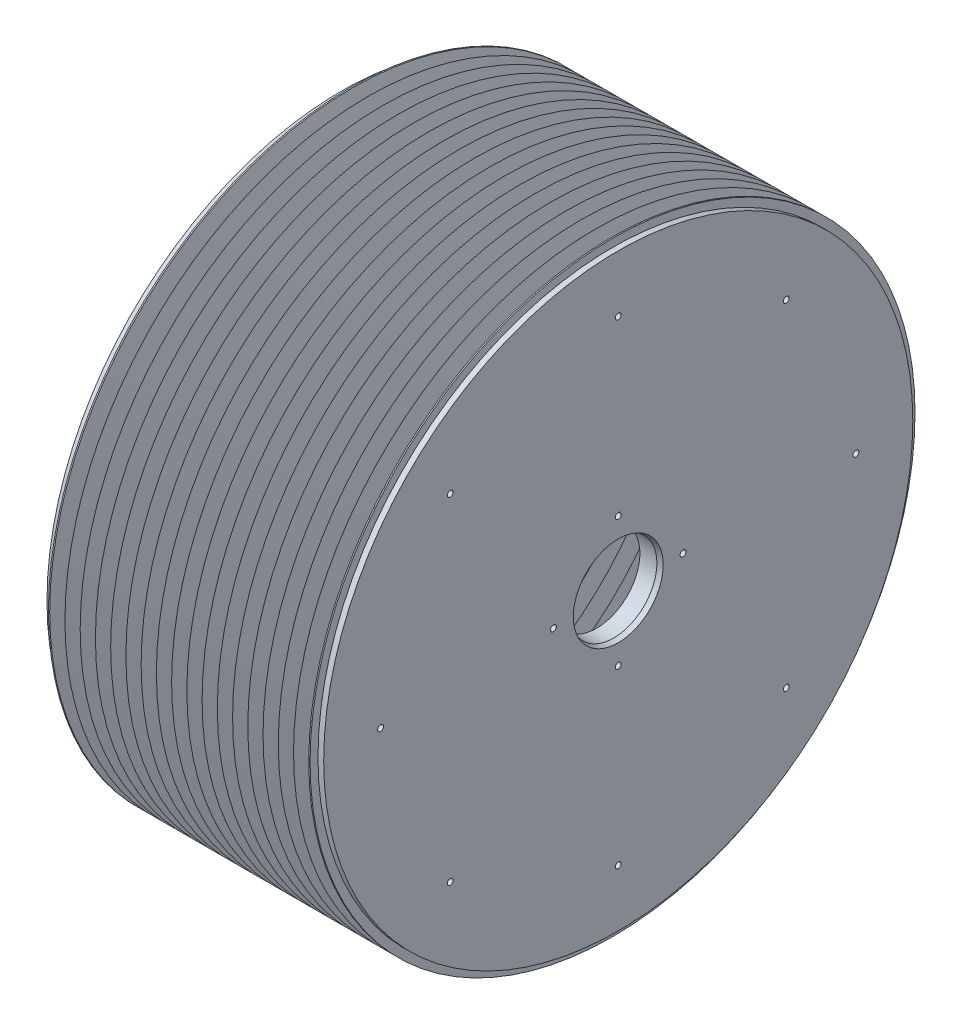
ISO-10303-21;
HEADER;
FILE_DESCRIPTION(('STEP AP214'),'2;1');
FILE_NAME('part.step','',(''),(''),'','','');
FILE_SCHEMA(('AUTOMOTIVE_DESIGN { 1 0 10303 214 1 1 1 1 }'));
ENDSEC;
DATA;
#1=APPLICATION_CONTEXT('core data for automotive mechanical design processes');
#2=APPLICATION_PROTOCOL_DEFINITION('international standard','automotive_design',2000,#1);
#3=PRODUCT_CONTEXT('',#1,'mechanical');
#4=PRODUCT('Part','Part','',(#3));
#5=PRODUCT_RELATED_PRODUCT_CATEGORY('part','',(#4));
#6=PRODUCT_DEFINITION_FORMATION('','',#4);
#7=PRODUCT_DEFINITION_CONTEXT('part definition',#1,'design');
#8=PRODUCT_DEFINITION('design','',#6,#7);
#9=PRODUCT_DEFINITION_SHAPE('','',#8);
#10=(LENGTH_UNIT() NAMED_UNIT(*) SI_UNIT(.MILLI.,.METRE.));
#11=(NAMED_UNIT(*) PLANE_ANGLE_UNIT() SI_UNIT($,.RADIAN.));
#12=(NAMED_UNIT(*) SI_UNIT($,.STERADIAN.) SOLID_ANGLE_UNIT());
#13=UNCERTAINTY_MEASURE_WITH_UNIT(LENGTH_MEASURE(1.E-05),#10,'distance_accuracy_value','');
#14=(GEOMETRIC_REPRESENTATION_CONTEXT(3) GLOBAL_UNCERTAINTY_ASSIGNED_CONTEXT((#13)) GLOBAL_UNIT_ASSIGNED_CONTEXT((#10,
#11,#12)) REPRESENTATION_CONTEXT('',''));
#15=CARTESIAN_POINT('',(0.,0.,0.));
#16=DIRECTION('',(0.,0.,1.));
#17=DIRECTION('',(1.,0.,0.));
#18=AXIS2_PLACEMENT_3D('',#15,#16,#17);
#19=CARTESIAN_POINT('',(-48.8988725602,0.,0.));
#20=DIRECTION('',(1.,0.,0.));
#21=DIRECTION('',(0.,0.,-1.));
#22=AXIS2_PLACEMENT_3D('',#19,#20,#21);
#23=CONICAL_SURFACE('',#22,177.8,1.39626340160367);
#24=CARTESIAN_POINT('',(-53.37757786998,0.,0.));
#25=DIRECTION('',(-1.,0.,0.));
#26=DIRECTION('',(0.,0.,1.));
#27=AXIS2_PLACEMENT_3D('',#24,#25,#26);
#28=CIRCLE('',#27,152.4);
#29=CARTESIAN_POINT('',(-53.37757786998,0.,152.4));
#30=VERTEX_POINT('',#29);
#31=EDGE_CURVE('E505',#30,#30,#28,.T.);
#32=ORIENTED_EDGE('',*,*,#31,.F.);
#33=EDGE_LOOP('',(#32));
#34=FACE_BOUND('',#33,.T.);
#35=CARTESIAN_POINT('',(-48.8988725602,0.,0.));
#36=DIRECTION('',(-1.,0.,0.));
#37=DIRECTION('',(0.,0.,1.));
#38=AXIS2_PLACEMENT_3D('',#35,#36,#37);
#39=CIRCLE('',#38,177.8);
#40=CARTESIAN_POINT('',(-48.8988725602,0.,177.8));
#41=VERTEX_POINT('',#40);
#42=EDGE_CURVE('E11',#41,#41,#39,.T.);
#43=ORIENTED_EDGE('',*,*,#42,.T.);
#44=EDGE_LOOP('',(#43));
#45=FACE_BOUND('',#44,.T.);
#46=ADVANCED_FACE('F381',(#34,#45),#23,.T.);
#47=CARTESIAN_POINT('',(-44.42016725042,0.,0.));
#48=DIRECTION('',(-1.,0.,0.));
#49=DIRECTION('',(0.,0.,1.));
#50=AXIS2_PLACEMENT_3D('',#47,#48,#49);
#51=CONICAL_SURFACE('',#50,152.4,1.39626340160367);
#52=ORIENTED_EDGE('',*,*,#42,.F.);
#53=EDGE_LOOP('',(#52));
#54=FACE_BOUND('',#53,.T.);
#55=CARTESIAN_POINT('',(-44.42016725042,0.,0.));
#56=DIRECTION('',(-1.,0.,0.));
#57=DIRECTION('',(0.,0.,1.));
#58=AXIS2_PLACEMENT_3D('',#55,#56,#57);
#59=CIRCLE('',#58,152.4);
#60=CARTESIAN_POINT('',(-44.42016725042,0.,152.4));
#61=VERTEX_POINT('',#60);
#62=EDGE_CURVE('E388',#61,#61,#59,.T.);
#63=ORIENTED_EDGE('',*,*,#62,.T.);
#64=EDGE_LOOP('',(#63));
#65=FACE_BOUND('',#64,.T.);
#66=ADVANCED_FACE('F744',(#54,#65),#51,.T.);
#67=CARTESIAN_POINT('',(-39.94146194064,0.,0.));
#68=DIRECTION('',(1.,0.,0.));
#69=DIRECTION('',(0.,0.,-1.));
#70=AXIS2_PLACEMENT_3D('',#67,#68,#69);
#71=CONICAL_SURFACE('',#70,177.8,1.39626340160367);
#72=ORIENTED_EDGE('',*,*,#62,.F.);
#73=EDGE_LOOP('',(#72));
#74=FACE_BOUND('',#73,.T.);
#75=CARTESIAN_POINT('',(-39.94146194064,0.,0.));
#76=DIRECTION('',(-1.,0.,0.));
#77=DIRECTION('',(0.,0.,1.));
#78=AXIS2_PLACEMENT_3D('',#75,#76,#77);
#79=CIRCLE('',#78,177.8);
#80=CARTESIAN_POINT('',(-39.94146194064,0.,177.8));
#81=VERTEX_POINT('',#80);
#82=EDGE_CURVE('E739',#81,#81,#79,.T.);
#83=ORIENTED_EDGE('',*,*,#82,.T.);
#84=EDGE_LOOP('',(#83));
#85=FACE_BOUND('',#84,.T.);
#86=ADVANCED_FACE('F746',(#74,#85),#71,.T.);
#87=CARTESIAN_POINT('',(-35.46275663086,0.,0.));
#88=DIRECTION('',(-1.,0.,0.));
#89=DIRECTION('',(0.,0.,1.));
#90=AXIS2_PLACEMENT_3D('',#87,#88,#89);
#91=CONICAL_SURFACE('',#90,152.4,1.39626340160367);
#92=ORIENTED_EDGE('',*,*,#82,.F.);
#93=EDGE_LOOP('',(#92));
#94=FACE_BOUND('',#93,.T.);
#95=CARTESIAN_POINT('',(-35.46275663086,0.,0.));
#96=DIRECTION('',(-1.,0.,0.));
#97=DIRECTION('',(0.,0.,1.));
#98=AXIS2_PLACEMENT_3D('',#95,#96,#97);
#99=CIRCLE('',#98,152.4);
#100=CARTESIAN_POINT('',(-35.46275663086,0.,152.4));
#101=VERTEX_POINT('',#100);
#102=EDGE_CURVE('E736',#101,#101,#99,.T.);
#103=ORIENTED_EDGE('',*,*,#102,.T.);
#104=EDGE_LOOP('',(#103));
#105=FACE_BOUND('',#104,.T.);
#106=ADVANCED_FACE('F749',(#94,#105),#91,.T.);
#107=CARTESIAN_POINT('',(-30.98405132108,0.,0.));
#108=DIRECTION('',(1.,0.,0.));
#109=DIRECTION('',(0.,0.,-1.));
#110=AXIS2_PLACEMENT_3D('',#107,#108,#109);
#111=CONICAL_SURFACE('',#110,177.8,1.39626340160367);
#112=ORIENTED_EDGE('',*,*,#102,.F.);
#113=EDGE_LOOP('',(#112));
#114=FACE_BOUND('',#113,.T.);
#115=CARTESIAN_POINT('',(-30.98405132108,0.,0.));
#116=DIRECTION('',(-1.,0.,0.));
#117=DIRECTION('',(0.,0.,1.));
#118=AXIS2_PLACEMENT_3D('',#115,#116,#117);
#119=CIRCLE('',#118,177.8);
#120=CARTESIAN_POINT('',(-30.98405132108,0.,177.8));
#121=VERTEX_POINT('',#120);
#122=EDGE_CURVE('E733',#121,#121,#119,.T.);
#123=ORIENTED_EDGE('',*,*,#122,.T.);
#124=EDGE_LOOP('',(#123));
#125=FACE_BOUND('',#124,.T.);
#126=ADVANCED_FACE('F755',(#114,#125),#111,.T.);
#127=CARTESIAN_POINT('',(-26.5053460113,0.,0.));
#128=DIRECTION('',(-1.,0.,0.));
#129=DIRECTION('',(0.,0.,1.));
#130=AXIS2_PLACEMENT_3D('',#127,#128,#129);
#131=CONICAL_SURFACE('',#130,152.4,1.39626340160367);
#132=ORIENTED_EDGE('',*,*,#122,.F.);
#133=EDGE_LOOP('',(#132));
#134=FACE_BOUND('',#133,.T.);
#135=CARTESIAN_POINT('',(-26.5053460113,0.,0.));
#136=DIRECTION('',(-1.,0.,0.));
#137=DIRECTION('',(0.,0.,1.));
#138=AXIS2_PLACEMENT_3D('',#135,#136,#137);
#139=CIRCLE('',#138,152.4);
#140=CARTESIAN_POINT('',(-26.5053460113,0.,152.4));
#141=VERTEX_POINT('',#140);
#142=EDGE_CURVE('E730',#141,#141,#139,.T.);
#143=ORIENTED_EDGE('',*,*,#142,.T.);
#144=EDGE_LOOP('',(#143));
#145=FACE_BOUND('',#144,.T.);
#146=ADVANCED_FACE('F761',(#134,#145),#131,.T.);
#147=CARTESIAN_POINT('',(-22.02664070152,0.,0.));
#148=DIRECTION('',(1.,0.,0.));
#149=DIRECTION('',(0.,0.,-1.));
#150=AXIS2_PLACEMENT_3D('',#147,#148,#149);
#151=CONICAL_SURFACE('',#150,177.8,1.39626340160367);
#152=ORIENTED_EDGE('',*,*,#142,.F.);
#153=EDGE_LOOP('',(#152));
#154=FACE_BOUND('',#153,.T.);
#155=CARTESIAN_POINT('',(-22.02664070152,0.,0.));
#156=DIRECTION('',(-1.,0.,0.));
#157=DIRECTION('',(0.,0.,1.));
#158=AXIS2_PLACEMENT_3D('',#155,#156,#157);
#159=CIRCLE('',#158,177.8);
#160=CARTESIAN_POINT('',(-22.02664070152,0.,177.8));
#161=VERTEX_POINT('',#160);
#162=EDGE_CURVE('E727',#161,#161,#159,.T.);
#163=ORIENTED_EDGE('',*,*,#162,.T.);
#164=EDGE_LOOP('',(#163));
#165=FACE_BOUND('',#164,.T.);
#166=ADVANCED_FACE('F767',(#154,#165),#151,.T.);
#167=CARTESIAN_POINT('',(-17.5479353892,0.,0.));
#168=DIRECTION('',(-1.,0.,0.));
#169=DIRECTION('',(0.,0.,1.));
#170=AXIS2_PLACEMENT_3D('',#167,#168,#169);
#171=CONICAL_SURFACE('',#170,152.4,1.39626340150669);
#172=ORIENTED_EDGE('',*,*,#162,.F.);
#173=EDGE_LOOP('',(#172));
#174=FACE_BOUND('',#173,.T.);
#175=CARTESIAN_POINT('',(-17.5479353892,0.,0.));
#176=DIRECTION('',(-1.,0.,0.));
#177=DIRECTION('',(0.,0.,1.));
#178=AXIS2_PLACEMENT_3D('',#175,#176,#177);
#179=CIRCLE('',#178,152.4);
#180=CARTESIAN_POINT('',(-17.5479353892,0.,152.4));
#181=VERTEX_POINT('',#180);
#182=EDGE_CURVE('E724',#181,#181,#179,.T.);
#183=ORIENTED_EDGE('',*,*,#182,.T.);
#184=EDGE_LOOP('',(#183));
#185=FACE_BOUND('',#184,.T.);
#186=ADVANCED_FACE('F773',(#174,#185),#171,.T.);
#187=CARTESIAN_POINT('',(-13.06923007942,0.,0.));
#188=DIRECTION('',(1.,0.,0.));
#189=DIRECTION('',(0.,0.,-1.));
#190=AXIS2_PLACEMENT_3D('',#187,#188,#189);
#191=CONICAL_SURFACE('',#190,177.8,1.39626340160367);
#192=ORIENTED_EDGE('',*,*,#182,.F.);
#193=EDGE_LOOP('',(#192));
#194=FACE_BOUND('',#193,.T.);
#195=CARTESIAN_POINT('',(-13.06923007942,0.,0.));
#196=DIRECTION('',(-1.,0.,0.));
#197=DIRECTION('',(0.,0.,1.));
#198=AXIS2_PLACEMENT_3D('',#195,#196,#197);
#199=CIRCLE('',#198,177.8);
#200=CARTESIAN_POINT('',(-13.06923007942,0.,177.8));
#201=VERTEX_POINT('',#200);
#202=EDGE_CURVE('E721',#201,#201,#199,.T.);
#203=ORIENTED_EDGE('',*,*,#202,.T.);
#204=EDGE_LOOP('',(#203));
#205=FACE_BOUND('',#204,.T.);
#206=ADVANCED_FACE('F779',(#194,#205),#191,.T.);
#207=CARTESIAN_POINT('',(-8.59052476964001,0.,0.));
#208=DIRECTION('',(-1.,0.,0.));
#209=DIRECTION('',(0.,0.,1.));
#210=AXIS2_PLACEMENT_3D('',#207,#208,#209);
#211=CONICAL_SURFACE('',#210,152.4,1.39626340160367);
#212=ORIENTED_EDGE('',*,*,#202,.F.);
#213=EDGE_LOOP('',(#212));
#214=FACE_BOUND('',#213,.T.);
#215=CARTESIAN_POINT('',(-8.59052476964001,0.,0.));
#216=DIRECTION('',(-1.,0.,0.));
#217=DIRECTION('',(0.,0.,1.));
#218=AXIS2_PLACEMENT_3D('',#215,#216,#217);
#219=CIRCLE('',#218,152.4);
#220=CARTESIAN_POINT('',(-8.59052476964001,0.,152.4));
#221=VERTEX_POINT('',#220);
#222=EDGE_CURVE('E718',#221,#221,#219,.T.);
#223=ORIENTED_EDGE('',*,*,#222,.T.);
#224=EDGE_LOOP('',(#223));
#225=FACE_BOUND('',#224,.T.);
#226=ADVANCED_FACE('F785',(#214,#225),#211,.T.);
#227=CARTESIAN_POINT('',(-4.11181945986,0.,0.));
#228=DIRECTION('',(1.,0.,0.));
#229=DIRECTION('',(0.,0.,-1.));
#230=AXIS2_PLACEMENT_3D('',#227,#228,#229);
#231=CONICAL_SURFACE('',#230,177.8,1.39626340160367);
#232=ORIENTED_EDGE('',*,*,#222,.F.);
#233=EDGE_LOOP('',(#232));
#234=FACE_BOUND('',#233,.T.);
#235=CARTESIAN_POINT('',(-4.11181945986,0.,0.));
#236=DIRECTION('',(-1.,0.,0.));
#237=DIRECTION('',(0.,0.,1.));
#238=AXIS2_PLACEMENT_3D('',#235,#236,#237);
#239=CIRCLE('',#238,177.8);
#240=CARTESIAN_POINT('',(-4.11181945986,0.,177.8));
#241=VERTEX_POINT('',#240);
#242=EDGE_CURVE('E715',#241,#241,#239,.T.);
#243=ORIENTED_EDGE('',*,*,#242,.T.);
#244=EDGE_LOOP('',(#243));
#245=FACE_BOUND('',#244,.T.);
#246=ADVANCED_FACE('F791',(#234,#245),#231,.T.);
#247=CARTESIAN_POINT('',(-144.20809857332,0.,0.));
#248=DIRECTION('',(-1.,0.,0.));
#249=DIRECTION('',(0.,0.,1.));
#250=AXIS2_PLACEMENT_3D('',#247,#248,#249);
#251=CYLINDRICAL_SURFACE('',#250,177.8);
#252=ORIENTED_EDGE('',*,*,#242,.F.);
#253=EDGE_LOOP('',(#252));
#254=FACE_BOUND('',#253,.T.);
#255=CARTESIAN_POINT('',(-3.34981945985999,0.,0.));
#256=DIRECTION('',(-1.,0.,0.));
#257=DIRECTION('',(0.,0.,1.));
#258=AXIS2_PLACEMENT_3D('',#255,#256,#257);
#259=CIRCLE('',#258,177.8);
#260=CARTESIAN_POINT('',(-3.34981945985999,0.,177.8));
#261=VERTEX_POINT('',#260);
#262=EDGE_CURVE('E712',#261,#261,#259,.T.);
#263=ORIENTED_EDGE('',*,*,#262,.T.);
#264=EDGE_LOOP('',(#263));
#265=FACE_BOUND('',#264,.T.);
#266=ADVANCED_FACE('F797',(#254,#265),#251,.T.);
#267=CARTESIAN_POINT('',(-3.34981945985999,173.14309568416,0.));
#268=DIRECTION('',(-1.,0.,0.));
#269=DIRECTION('',(0.,0.,1.));
#270=AXIS2_PLACEMENT_3D('',#267,#268,#269);
#271=PLANE('',#270);
#272=ORIENTED_EDGE('',*,*,#262,.F.);
#273=EDGE_LOOP('',(#272));
#274=FACE_BOUND('',#273,.T.);
#275=CARTESIAN_POINT('',(-3.34981945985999,0.,0.));
#276=DIRECTION('',(-1.,0.,0.));
#277=DIRECTION('',(0.,0.,1.));
#278=AXIS2_PLACEMENT_3D('',#275,#276,#277);
#279=CIRCLE('',#278,173.14309568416);
#280=CARTESIAN_POINT('',(-3.34981945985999,0.,173.14309568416));
#281=VERTEX_POINT('',#280);
#282=EDGE_CURVE('E709',#281,#281,#279,.T.);
#283=ORIENTED_EDGE('',*,*,#282,.T.);
#284=EDGE_LOOP('',(#283));
#285=FACE_BOUND('',#284,.T.);
#286=ADVANCED_FACE('F803',(#274,#285),#271,.F.);
#287=CARTESIAN_POINT('',(-144.20809857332,0.,0.));
#288=DIRECTION('',(-1.,0.,0.));
#289=DIRECTION('',(0.,0.,1.));
#290=AXIS2_PLACEMENT_3D('',#287,#288,#289);
#291=CYLINDRICAL_SURFACE('',#290,173.14309568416);
#292=ORIENTED_EDGE('',*,*,#282,.F.);
#293=EDGE_LOOP('',(#292));
#294=FACE_BOUND('',#293,.T.);
#295=CARTESIAN_POINT('',(0.,0.,0.));
#296=DIRECTION('',(-1.,0.,0.));
#297=DIRECTION('',(0.,0.,1.));
#298=AXIS2_PLACEMENT_3D('',#295,#296,#297);
#299=CIRCLE('',#298,173.14309568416);
#300=CARTESIAN_POINT('',(0.,0.,173.14309568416));
#301=VERTEX_POINT('',#300);
#302=EDGE_CURVE('E706',#301,#301,#299,.T.);
#303=ORIENTED_EDGE('',*,*,#302,.T.);
#304=EDGE_LOOP('',(#303));
#305=FACE_BOUND('',#304,.T.);
#306=ADVANCED_FACE('F809',(#294,#305),#291,.T.);
#307=CARTESIAN_POINT('',(0.,26.416,0.));
#308=DIRECTION('',(-1.,0.,0.));
#309=DIRECTION('',(0.,0.,1.));
#310=AXIS2_PLACEMENT_3D('',#307,#308,#309);
#311=PLANE('',#310);
#312=CARTESIAN_POINT('',(0.,98.7828173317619,-98.7828173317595));
#313=DIRECTION('',(1.,0.,0.));
#314=DIRECTION('',(0.,0.,-1.));
#315=AXIS2_PLACEMENT_3D('',#312,#313,#314);
#316=CIRCLE('',#315,1.72719999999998);
#317=CARTESIAN_POINT('',(0.,98.7828173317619,-100.510017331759));
#318=VERTEX_POINT('',#317);
#319=EDGE_CURVE('E434',#318,#318,#316,.T.);
#320=ORIENTED_EDGE('',*,*,#319,.F.);
#321=EDGE_LOOP('',(#320));
#322=FACE_BOUND('',#321,.T.);
#323=CARTESIAN_POINT('',(0.,1.46328067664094E-12,-139.7));
#324=DIRECTION('',(1.,0.,0.));
#325=DIRECTION('',(0.,0.,-1.));
#326=AXIS2_PLACEMENT_3D('',#323,#324,#325);
#327=CIRCLE('',#326,1.72719999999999);
#328=CARTESIAN_POINT('',(0.,1.46328067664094E-12,-141.4272));
#329=VERTEX_POINT('',#328);
#330=EDGE_CURVE('E442',#329,#329,#327,.T.);
#331=ORIENTED_EDGE('',*,*,#330,.F.);
#332=EDGE_LOOP('',(#331));
#333=FACE_BOUND('',#332,.T.);
#334=CARTESIAN_POINT('',(0.,-98.7828173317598,-98.7828173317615));
#335=DIRECTION('',(1.,0.,0.));
#336=DIRECTION('',(0.,0.,-1.));
#337=AXIS2_PLACEMENT_3D('',#334,#335,#336);
#338=CIRCLE('',#337,1.72719999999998);
#339=CARTESIAN_POINT('',(0.,-98.7828173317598,-100.510017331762));
#340=VERTEX_POINT('',#339);
#341=EDGE_CURVE('E448',#340,#340,#338,.T.);
#342=ORIENTED_EDGE('',*,*,#341,.F.);
#343=EDGE_LOOP('',(#342));
#344=FACE_BOUND('',#343,.T.);
#345=CARTESIAN_POINT('',(0.,-139.7,-9.75520451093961E-13));
#346=DIRECTION('',(1.,0.,0.));
#347=DIRECTION('',(0.,0.,-1.));
#348=AXIS2_PLACEMENT_3D('',#345,#346,#347);
#349=CIRCLE('',#348,1.72719999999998);
#350=CARTESIAN_POINT('',(0.,-139.7,-1.72720000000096));
#351=VERTEX_POINT('',#350);
#352=EDGE_CURVE('E454',#351,#351,#349,.T.);
#353=ORIENTED_EDGE('',*,*,#352,.F.);
#354=EDGE_LOOP('',(#353));
#355=FACE_BOUND('',#354,.T.);
#356=CARTESIAN_POINT('',(0.,-98.7828173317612,98.7828173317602));
#357=DIRECTION('',(1.,0.,0.));
#358=DIRECTION('',(0.,0.,-1.));
#359=AXIS2_PLACEMENT_3D('',#356,#357,#358);
#360=CIRCLE('',#359,1.72719999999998);
#361=CARTESIAN_POINT('',(0.,-98.7828173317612,97.0556173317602));
#362=VERTEX_POINT('',#361);
#363=EDGE_CURVE('E460',#362,#362,#360,.T.);
#364=ORIENTED_EDGE('',*,*,#363,.F.);
#365=EDGE_LOOP('',(#364));
#366=FACE_BOUND('',#365,.T.);
#367=CARTESIAN_POINT('',(0.,-4.87760225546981E-13,139.7));
#368=DIRECTION('',(1.,0.,0.));
#369=DIRECTION('',(0.,0.,-1.));
#370=AXIS2_PLACEMENT_3D('',#367,#368,#369);
#371=CIRCLE('',#370,1.72719999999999);
#372=CARTESIAN_POINT('',(0.,-4.87760225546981E-13,137.9728));
#373=VERTEX_POINT('',#372);
#374=EDGE_CURVE('E466',#373,#373,#371,.T.);
#375=ORIENTED_EDGE('',*,*,#374,.F.);
#376=EDGE_LOOP('',(#375));
#377=FACE_BOUND('',#376,.T.);
#378=CARTESIAN_POINT('',(0.,98.7828173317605,98.7828173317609));
#379=DIRECTION('',(1.,0.,0.));
#380=DIRECTION('',(0.,0.,-1.));
#381=AXIS2_PLACEMENT_3D('',#378,#379,#380);
#382=CIRCLE('',#381,1.72719999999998);
#383=CARTESIAN_POINT('',(0.,98.7828173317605,97.0556173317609));
#384=VERTEX_POINT('',#383);
#385=EDGE_CURVE('E472',#384,#384,#382,.T.);
#386=ORIENTED_EDGE('',*,*,#385,.F.);
#387=EDGE_LOOP('',(#386));
#388=FACE_BOUND('',#387,.T.);
#389=CARTESIAN_POINT('',(0.,139.7,0.));
#390=DIRECTION('',(1.,0.,0.));
#391=DIRECTION('',(0.,0.,-1.));
#392=AXIS2_PLACEMENT_3D('',#389,#390,#391);
#393=CIRCLE('',#392,1.72719999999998);
#394=CARTESIAN_POINT('',(0.,139.7,-1.72719999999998));
#395=VERTEX_POINT('',#394);
#396=EDGE_CURVE('E478',#395,#395,#393,.T.);
#397=ORIENTED_EDGE('',*,*,#396,.F.);
#398=EDGE_LOOP('',(#397));
#399=FACE_BOUND('',#398,.T.);
#400=CARTESIAN_POINT('',(0.,38.1,0.));
#401=DIRECTION('',(1.,0.,0.));
#402=DIRECTION('',(0.,0.,-1.));
#403=AXIS2_PLACEMENT_3D('',#400,#401,#402);
#404=CIRCLE('',#403,1.72719999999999);
#405=CARTESIAN_POINT('',(0.,38.1,-1.72719999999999));
#406=VERTEX_POINT('',#405);
#407=EDGE_CURVE('E484',#406,#406,#404,.T.);
#408=ORIENTED_EDGE('',*,*,#407,.F.);
#409=EDGE_LOOP('',(#408));
#410=FACE_BOUND('',#409,.T.);
#411=CARTESIAN_POINT('',(0.,-38.1,0.));
#412=DIRECTION('',(1.,0.,0.));
#413=DIRECTION('',(0.,0.,-1.));
#414=AXIS2_PLACEMENT_3D('',#411,#412,#413);
#415=CIRCLE('',#414,1.72719999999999);
#416=CARTESIAN_POINT('',(0.,-38.1,-1.72719999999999));
#417=VERTEX_POINT('',#416);
#418=EDGE_CURVE('E490',#417,#417,#415,.T.);
#419=ORIENTED_EDGE('',*,*,#418,.F.);
#420=EDGE_LOOP('',(#419));
#421=FACE_BOUND('',#420,.T.);
#422=CARTESIAN_POINT('',(0.,0.,38.1));
#423=DIRECTION('',(1.,0.,0.));
#424=DIRECTION('',(0.,0.,-1.));
#425=AXIS2_PLACEMENT_3D('',#422,#423,#424);
#426=CIRCLE('',#425,1.72719999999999);
#427=CARTESIAN_POINT('',(0.,0.,36.3728));
#428=VERTEX_POINT('',#427);
#429=EDGE_CURVE('E496',#428,#428,#426,.T.);
#430=ORIENTED_EDGE('',*,*,#429,.F.);
#431=EDGE_LOOP('',(#430));
#432=FACE_BOUND('',#431,.T.);
#433=CARTESIAN_POINT('',(0.,0.,-38.1));
#434=DIRECTION('',(1.,0.,0.));
#435=DIRECTION('',(0.,0.,-1.));
#436=AXIS2_PLACEMENT_3D('',#433,#434,#435);
#437=CIRCLE('',#436,1.72719999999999);
#438=CARTESIAN_POINT('',(0.,0.,-39.8272));
#439=VERTEX_POINT('',#438);
#440=EDGE_CURVE('E502',#439,#439,#437,.T.);
#441=ORIENTED_EDGE('',*,*,#440,.F.);
#442=EDGE_LOOP('',(#441));
#443=FACE_BOUND('',#442,.T.);
#444=ORIENTED_EDGE('',*,*,#302,.F.);
#445=EDGE_LOOP('',(#444));
#446=FACE_BOUND('',#445,.T.);
#447=CARTESIAN_POINT('',(0.,0.,0.));
#448=DIRECTION('',(-1.,0.,0.));
#449=DIRECTION('',(0.,0.,1.));
#450=AXIS2_PLACEMENT_3D('',#447,#448,#449);
#451=CIRCLE('',#450,26.416);
#452=CARTESIAN_POINT('',(0.,0.,26.416));
#453=VERTEX_POINT('',#452);
#454=EDGE_CURVE('E703',#453,#453,#451,.T.);
#455=ORIENTED_EDGE('',*,*,#454,.T.);
#456=EDGE_LOOP('',(#455));
#457=FACE_BOUND('',#456,.T.);
#458=ADVANCED_FACE('F815',(#322,#333,#344,#355,#366,#377,#388,#399,#410,#421,#432,#443,#446,
#457),#311,.F.);
#459=CARTESIAN_POINT('',(-2.72165113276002,0.,0.));
#460=DIRECTION('',(1.,0.,0.));
#461=DIRECTION('',(0.,0.,-1.));
#462=AXIS2_PLACEMENT_3D('',#459,#460,#461);
#463=CONICAL_SURFACE('',#462,25.4254,0.349065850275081);
#464=ORIENTED_EDGE('',*,*,#454,.F.);
#465=EDGE_LOOP('',(#464));
#466=FACE_BOUND('',#465,.T.);
#467=CARTESIAN_POINT('',(-2.72165113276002,0.,0.));
#468=DIRECTION('',(-1.,0.,0.));
#469=DIRECTION('',(0.,0.,1.));
#470=AXIS2_PLACEMENT_3D('',#467,#468,#469);
#471=CIRCLE('',#470,25.4254);
#472=CARTESIAN_POINT('',(-2.72165113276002,0.,25.4254));
#473=VERTEX_POINT('',#472);
#474=EDGE_CURVE('E700',#473,#473,#471,.T.);
#475=ORIENTED_EDGE('',*,*,#474,.T.);
#476=EDGE_LOOP('',(#475));
#477=FACE_BOUND('',#476,.T.);
#478=ADVANCED_FACE('F821',(#466,#477),#463,.F.);
#479=CARTESIAN_POINT('',(-144.20809857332,0.,0.));
#480=DIRECTION('',(-1.,0.,0.));
#481=DIRECTION('',(0.,0.,1.));
#482=AXIS2_PLACEMENT_3D('',#479,#480,#481);
#483=CYLINDRICAL_SURFACE('',#482,25.4254);
#484=ORIENTED_EDGE('',*,*,#474,.F.);
#485=EDGE_LOOP('',(#484));
#486=FACE_BOUND('',#485,.T.);
#487=CARTESIAN_POINT('',(-12.7,0.,0.));
#488=DIRECTION('',(-1.,0.,0.));
#489=DIRECTION('',(0.,0.,1.));
#490=AXIS2_PLACEMENT_3D('',#487,#488,#489);
#491=CIRCLE('',#490,25.4254);
#492=CARTESIAN_POINT('',(-12.7,0.,25.4254));
#493=VERTEX_POINT('',#492);
#494=EDGE_CURVE('E697',#493,#493,#491,.T.);
#495=ORIENTED_EDGE('',*,*,#494,.T.);
#496=EDGE_LOOP('',(#495));
#497=FACE_BOUND('',#496,.T.);
#498=ADVANCED_FACE('F828',(#486,#497),#483,.F.);
#499=CARTESIAN_POINT('',(-12.7,25.4254,0.));
#500=DIRECTION('',(1.,0.,0.));
#501=DIRECTION('',(0.,0.,-1.));
#502=AXIS2_PLACEMENT_3D('',#499,#500,#501);
#503=PLANE('',#502);
#504=ORIENTED_EDGE('',*,*,#494,.F.);
#505=EDGE_LOOP('',(#504));
#506=FACE_BOUND('',#505,.T.);
#507=CARTESIAN_POINT('',(-12.7,0.,0.));
#508=DIRECTION('',(-1.,0.,0.));
#509=DIRECTION('',(0.,0.,1.));
#510=AXIS2_PLACEMENT_3D('',#507,#508,#509);
#511=CIRCLE('',#510,148.21281556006);
#512=CARTESIAN_POINT('',(-12.7,0.,148.21281556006));
#513=VERTEX_POINT('',#512);
#514=EDGE_CURVE('E694',#513,#513,#511,.T.);
#515=ORIENTED_EDGE('',*,*,#514,.T.);
#516=EDGE_LOOP('',(#515));
#517=FACE_BOUND('',#516,.T.);
#518=ADVANCED_FACE('F834',(#506,#517),#503,.F.);
#519=CARTESIAN_POINT('',(-144.20809857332,0.,0.));
#520=DIRECTION('',(-1.,0.,0.));
#521=DIRECTION('',(0.,0.,1.));
#522=AXIS2_PLACEMENT_3D('',#519,#520,#521);
#523=CYLINDRICAL_SURFACE('',#522,148.21281556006);
#524=ORIENTED_EDGE('',*,*,#514,.F.);
#525=EDGE_LOOP('',(#524));
#526=FACE_BOUND('',#525,.T.);
#527=CARTESIAN_POINT('',(-4.11181945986,0.,0.));
#528=DIRECTION('',(-1.,0.,0.));
#529=DIRECTION('',(0.,0.,1.));
#530=AXIS2_PLACEMENT_3D('',#527,#528,#529);
#531=CIRCLE('',#530,148.21281556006);
#532=CARTESIAN_POINT('',(-4.11181945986,0.,148.21281556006));
#533=VERTEX_POINT('',#532);
#534=EDGE_CURVE('E691',#533,#533,#531,.T.);
#535=ORIENTED_EDGE('',*,*,#534,.T.);
#536=EDGE_LOOP('',(#535));
#537=FACE_BOUND('',#536,.T.);
#538=ADVANCED_FACE('F840',(#526,#537),#523,.T.);
#539=CARTESIAN_POINT('',(-4.11181945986,148.21281556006,0.));
#540=DIRECTION('',(1.,0.,0.));
#541=DIRECTION('',(0.,0.,-1.));
#542=AXIS2_PLACEMENT_3D('',#539,#540,#541);
#543=PLANE('',#542);
#544=ORIENTED_EDGE('',*,*,#534,.F.);
#545=EDGE_LOOP('',(#544));
#546=FACE_BOUND('',#545,.T.);
#547=CARTESIAN_POINT('',(-4.11181945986,0.,0.));
#548=DIRECTION('',(-1.,0.,0.));
#549=DIRECTION('',(0.,0.,1.));
#550=AXIS2_PLACEMENT_3D('',#547,#548,#549);
#551=CIRCLE('',#550,176.33727229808);
#552=CARTESIAN_POINT('',(-4.11181945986,0.,176.33727229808));
#553=VERTEX_POINT('',#552);
#554=EDGE_CURVE('E688',#553,#553,#551,.T.);
#555=ORIENTED_EDGE('',*,*,#554,.T.);
#556=EDGE_LOOP('',(#555));
#557=FACE_BOUND('',#556,.T.);
#558=ADVANCED_FACE('F846',(#546,#557),#543,.F.);
#559=CARTESIAN_POINT('',(-8.59052476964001,0.,0.));
#560=DIRECTION('',(1.,0.,0.));
#561=DIRECTION('',(0.,0.,-1.));
#562=AXIS2_PLACEMENT_3D('',#559,#560,#561);
#563=CONICAL_SURFACE('',#562,150.93727229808,1.39626340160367);
#564=ORIENTED_EDGE('',*,*,#554,.F.);
#565=EDGE_LOOP('',(#564));
#566=FACE_BOUND('',#565,.T.);
#567=CARTESIAN_POINT('',(-8.59052476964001,0.,0.));
#568=DIRECTION('',(-1.,0.,0.));
#569=DIRECTION('',(0.,0.,1.));
#570=AXIS2_PLACEMENT_3D('',#567,#568,#569);
#571=CIRCLE('',#570,150.93727229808);
#572=CARTESIAN_POINT('',(-8.59052476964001,0.,150.93727229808));
#573=VERTEX_POINT('',#572);
#574=EDGE_CURVE('E685',#573,#573,#571,.T.);
#575=ORIENTED_EDGE('',*,*,#574,.T.);
#576=EDGE_LOOP('',(#575));
#577=FACE_BOUND('',#576,.T.);
#578=ADVANCED_FACE('F852',(#566,#577),#563,.F.);
#579=CARTESIAN_POINT('',(-13.06923007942,0.,0.));
#580=DIRECTION('',(-1.,0.,0.));
#581=DIRECTION('',(0.,0.,1.));
#582=AXIS2_PLACEMENT_3D('',#579,#580,#581);
#583=CONICAL_SURFACE('',#582,176.33727229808,1.39626340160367);
#584=ORIENTED_EDGE('',*,*,#574,.F.);
#585=EDGE_LOOP('',(#584));
#586=FACE_BOUND('',#585,.T.);
#587=CARTESIAN_POINT('',(-13.06923007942,0.,0.));
#588=DIRECTION('',(-1.,0.,0.));
#589=DIRECTION('',(0.,0.,1.));
#590=AXIS2_PLACEMENT_3D('',#587,#588,#589);
#591=CIRCLE('',#590,176.33727229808);
#592=CARTESIAN_POINT('',(-13.06923007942,0.,176.33727229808));
#593=VERTEX_POINT('',#592);
#594=EDGE_CURVE('E682',#593,#593,#591,.T.);
#595=ORIENTED_EDGE('',*,*,#594,.T.);
#596=EDGE_LOOP('',(#595));
#597=FACE_BOUND('',#596,.T.);
#598=ADVANCED_FACE('F858',(#586,#597),#583,.F.);
#599=CARTESIAN_POINT('',(-17.5479353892,0.,0.));
#600=DIRECTION('',(1.,0.,0.));
#601=DIRECTION('',(0.,0.,-1.));
#602=AXIS2_PLACEMENT_3D('',#599,#600,#601);
#603=CONICAL_SURFACE('',#602,150.93727229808,1.39626340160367);
#604=ORIENTED_EDGE('',*,*,#594,.F.);
#605=EDGE_LOOP('',(#604));
#606=FACE_BOUND('',#605,.T.);
#607=CARTESIAN_POINT('',(-17.5479353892,0.,0.));
#608=DIRECTION('',(-1.,0.,0.));
#609=DIRECTION('',(0.,0.,1.));
#610=AXIS2_PLACEMENT_3D('',#607,#608,#609);
#611=CIRCLE('',#610,150.93727229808);
#612=CARTESIAN_POINT('',(-17.5479353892,0.,150.93727229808));
#613=VERTEX_POINT('',#612);
#614=EDGE_CURVE('E679',#613,#613,#611,.T.);
#615=ORIENTED_EDGE('',*,*,#614,.T.);
#616=EDGE_LOOP('',(#615));
#617=FACE_BOUND('',#616,.T.);
#618=ADVANCED_FACE('F864',(#606,#617),#603,.F.);
#619=CARTESIAN_POINT('',(-22.02664070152,0.,0.));
#620=DIRECTION('',(-1.,0.,0.));
#621=DIRECTION('',(0.,0.,1.));
#622=AXIS2_PLACEMENT_3D('',#619,#620,#621);
#623=CONICAL_SURFACE('',#622,176.33727229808,1.39626340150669);
#624=ORIENTED_EDGE('',*,*,#614,.F.);
#625=EDGE_LOOP('',(#624));
#626=FACE_BOUND('',#625,.T.);
#627=CARTESIAN_POINT('',(-22.02664070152,0.,0.));
#628=DIRECTION('',(-1.,0.,0.));
#629=DIRECTION('',(0.,0.,1.));
#630=AXIS2_PLACEMENT_3D('',#627,#628,#629);
#631=CIRCLE('',#630,176.33727229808);
#632=CARTESIAN_POINT('',(-22.02664070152,0.,176.33727229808));
#633=VERTEX_POINT('',#632);
#634=EDGE_CURVE('E676',#633,#633,#631,.T.);
#635=ORIENTED_EDGE('',*,*,#634,.T.);
#636=EDGE_LOOP('',(#635));
#637=FACE_BOUND('',#636,.T.);
#638=ADVANCED_FACE('F870',(#626,#637),#623,.F.);
#639=CARTESIAN_POINT('',(-26.5053460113,0.,0.));
#640=DIRECTION('',(1.,0.,0.));
#641=DIRECTION('',(0.,0.,-1.));
#642=AXIS2_PLACEMENT_3D('',#639,#640,#641);
#643=CONICAL_SURFACE('',#642,150.93727229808,1.39626340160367);
#644=ORIENTED_EDGE('',*,*,#634,.F.);
#645=EDGE_LOOP('',(#644));
#646=FACE_BOUND('',#645,.T.);
#647=CARTESIAN_POINT('',(-26.5053460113,0.,0.));
#648=DIRECTION('',(-1.,0.,0.));
#649=DIRECTION('',(0.,0.,1.));
#650=AXIS2_PLACEMENT_3D('',#647,#648,#649);
#651=CIRCLE('',#650,150.93727229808);
#652=CARTESIAN_POINT('',(-26.5053460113,0.,150.93727229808));
#653=VERTEX_POINT('',#652);
#654=EDGE_CURVE('E673',#653,#653,#651,.T.);
#655=ORIENTED_EDGE('',*,*,#654,.T.);
#656=EDGE_LOOP('',(#655));
#657=FACE_BOUND('',#656,.T.);
#658=ADVANCED_FACE('F876',(#646,#657),#643,.F.);
#659=CARTESIAN_POINT('',(-30.98405132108,0.,0.));
#660=DIRECTION('',(-1.,0.,0.));
#661=DIRECTION('',(0.,0.,1.));
#662=AXIS2_PLACEMENT_3D('',#659,#660,#661);
#663=CONICAL_SURFACE('',#662,176.33727229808,1.39626340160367);
#664=ORIENTED_EDGE('',*,*,#654,.F.);
#665=EDGE_LOOP('',(#664));
#666=FACE_BOUND('',#665,.T.);
#667=CARTESIAN_POINT('',(-30.98405132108,0.,0.));
#668=DIRECTION('',(-1.,0.,0.));
#669=DIRECTION('',(0.,0.,1.));
#670=AXIS2_PLACEMENT_3D('',#667,#668,#669);
#671=CIRCLE('',#670,176.33727229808);
#672=CARTESIAN_POINT('',(-30.98405132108,0.,176.33727229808));
#673=VERTEX_POINT('',#672);
#674=EDGE_CURVE('E670',#673,#673,#671,.T.);
#675=ORIENTED_EDGE('',*,*,#674,.T.);
#676=EDGE_LOOP('',(#675));
#677=FACE_BOUND('',#676,.T.);
#678=ADVANCED_FACE('F882',(#666,#677),#663,.F.);
#679=CARTESIAN_POINT('',(-35.46275663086,0.,0.));
#680=DIRECTION('',(1.,0.,0.));
#681=DIRECTION('',(0.,0.,-1.));
#682=AXIS2_PLACEMENT_3D('',#679,#680,#681);
#683=CONICAL_SURFACE('',#682,150.93727229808,1.39626340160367);
#684=ORIENTED_EDGE('',*,*,#674,.F.);
#685=EDGE_LOOP('',(#684));
#686=FACE_BOUND('',#685,.T.);
#687=CARTESIAN_POINT('',(-35.46275663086,0.,0.));
#688=DIRECTION('',(-1.,0.,0.));
#689=DIRECTION('',(0.,0.,1.));
#690=AXIS2_PLACEMENT_3D('',#687,#688,#689);
#691=CIRCLE('',#690,150.93727229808);
#692=CARTESIAN_POINT('',(-35.46275663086,0.,150.93727229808));
#693=VERTEX_POINT('',#692);
#694=EDGE_CURVE('E667',#693,#693,#691,.T.);
#695=ORIENTED_EDGE('',*,*,#694,.T.);
#696=EDGE_LOOP('',(#695));
#697=FACE_BOUND('',#696,.T.);
#698=ADVANCED_FACE('F888',(#686,#697),#683,.F.);
#699=CARTESIAN_POINT('',(-39.94146194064,0.,0.));
#700=DIRECTION('',(-1.,0.,0.));
#701=DIRECTION('',(0.,0.,1.));
#702=AXIS2_PLACEMENT_3D('',#699,#700,#701);
#703=CONICAL_SURFACE('',#702,176.33727229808,1.39626340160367);
#704=ORIENTED_EDGE('',*,*,#694,.F.);
#705=EDGE_LOOP('',(#704));
#706=FACE_BOUND('',#705,.T.);
#707=CARTESIAN_POINT('',(-39.94146194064,0.,0.));
#708=DIRECTION('',(-1.,0.,0.));
#709=DIRECTION('',(0.,0.,1.));
#710=AXIS2_PLACEMENT_3D('',#707,#708,#709);
#711=CIRCLE('',#710,176.33727229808);
#712=CARTESIAN_POINT('',(-39.94146194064,0.,176.33727229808));
#713=VERTEX_POINT('',#712);
#714=EDGE_CURVE('E664',#713,#713,#711,.T.);
#715=ORIENTED_EDGE('',*,*,#714,.T.);
#716=EDGE_LOOP('',(#715));
#717=FACE_BOUND('',#716,.T.);
#718=ADVANCED_FACE('F894',(#706,#717),#703,.F.);
#719=CARTESIAN_POINT('',(-44.42016725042,0.,0.));
#720=DIRECTION('',(1.,0.,0.));
#721=DIRECTION('',(0.,0.,-1.));
#722=AXIS2_PLACEMENT_3D('',#719,#720,#721);
#723=CONICAL_SURFACE('',#722,150.93727229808,1.39626340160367);
#724=ORIENTED_EDGE('',*,*,#714,.F.);
#725=EDGE_LOOP('',(#724));
#726=FACE_BOUND('',#725,.T.);
#727=CARTESIAN_POINT('',(-44.42016725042,0.,0.));
#728=DIRECTION('',(-1.,0.,0.));
#729=DIRECTION('',(0.,0.,1.));
#730=AXIS2_PLACEMENT_3D('',#727,#728,#729);
#731=CIRCLE('',#730,150.93727229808);
#732=CARTESIAN_POINT('',(-44.42016725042,0.,150.93727229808));
#733=VERTEX_POINT('',#732);
#734=EDGE_CURVE('E661',#733,#733,#731,.T.);
#735=ORIENTED_EDGE('',*,*,#734,.T.);
#736=EDGE_LOOP('',(#735));
#737=FACE_BOUND('',#736,.T.);
#738=ADVANCED_FACE('F900',(#726,#737),#723,.F.);
#739=CARTESIAN_POINT('',(-48.8988725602,0.,0.));
#740=DIRECTION('',(-1.,0.,0.));
#741=DIRECTION('',(0.,0.,1.));
#742=AXIS2_PLACEMENT_3D('',#739,#740,#741);
#743=CONICAL_SURFACE('',#742,176.33727229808,1.39626340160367);
#744=ORIENTED_EDGE('',*,*,#734,.F.);
#745=EDGE_LOOP('',(#744));
#746=FACE_BOUND('',#745,.T.);
#747=CARTESIAN_POINT('',(-48.8988725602,0.,0.));
#748=DIRECTION('',(-1.,0.,0.));
#749=DIRECTION('',(0.,0.,1.));
#750=AXIS2_PLACEMENT_3D('',#747,#748,#749);
#751=CIRCLE('',#750,176.33727229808);
#752=CARTESIAN_POINT('',(-48.8988725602,0.,176.33727229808));
#753=VERTEX_POINT('',#752);
#754=EDGE_CURVE('E658',#753,#753,#751,.T.);
#755=ORIENTED_EDGE('',*,*,#754,.T.);
#756=EDGE_LOOP('',(#755));
#757=FACE_BOUND('',#756,.T.);
#758=ADVANCED_FACE('F906',(#746,#757),#743,.F.);
#759=CARTESIAN_POINT('',(-53.37757786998,0.,0.));
#760=DIRECTION('',(1.,0.,0.));
#761=DIRECTION('',(0.,0.,-1.));
#762=AXIS2_PLACEMENT_3D('',#759,#760,#761);
#763=CONICAL_SURFACE('',#762,150.93727229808,1.39626340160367);
#764=ORIENTED_EDGE('',*,*,#754,.F.);
#765=EDGE_LOOP('',(#764));
#766=FACE_BOUND('',#765,.T.);
#767=CARTESIAN_POINT('',(-53.37757786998,0.,0.));
#768=DIRECTION('',(-1.,0.,0.));
#769=DIRECTION('',(0.,0.,1.));
#770=AXIS2_PLACEMENT_3D('',#767,#768,#769);
#771=CIRCLE('',#770,150.93727229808);
#772=CARTESIAN_POINT('',(-53.37757786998,0.,150.93727229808));
#773=VERTEX_POINT('',#772);
#774=EDGE_CURVE('E655',#773,#773,#771,.T.);
#775=ORIENTED_EDGE('',*,*,#774,.T.);
#776=EDGE_LOOP('',(#775));
#777=FACE_BOUND('',#776,.T.);
#778=ADVANCED_FACE('F912',(#766,#777),#763,.F.);
#779=CARTESIAN_POINT('',(-57.85628317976,0.,0.));
#780=DIRECTION('',(-1.,0.,0.));
#781=DIRECTION('',(0.,0.,1.));
#782=AXIS2_PLACEMENT_3D('',#779,#780,#781);
#783=CONICAL_SURFACE('',#782,176.33727229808,1.39626340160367);
#784=ORIENTED_EDGE('',*,*,#774,.F.);
#785=EDGE_LOOP('',(#784));
#786=FACE_BOUND('',#785,.T.);
#787=CARTESIAN_POINT('',(-57.85628317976,0.,0.));
#788=DIRECTION('',(-1.,0.,0.));
#789=DIRECTION('',(0.,0.,1.));
#790=AXIS2_PLACEMENT_3D('',#787,#788,#789);
#791=CIRCLE('',#790,176.33727229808);
#792=CARTESIAN_POINT('',(-57.85628317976,0.,176.33727229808));
#793=VERTEX_POINT('',#792);
#794=EDGE_CURVE('E652',#793,#793,#791,.T.);
#795=ORIENTED_EDGE('',*,*,#794,.T.);
#796=EDGE_LOOP('',(#795));
#797=FACE_BOUND('',#796,.T.);
#798=ADVANCED_FACE('F918',(#786,#797),#783,.F.);
#799=CARTESIAN_POINT('',(-62.33498848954,0.,0.));
#800=DIRECTION('',(1.,0.,0.));
#801=DIRECTION('',(0.,0.,-1.));
#802=AXIS2_PLACEMENT_3D('',#799,#800,#801);
#803=CONICAL_SURFACE('',#802,150.93727229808,1.39626340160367);
#804=ORIENTED_EDGE('',*,*,#794,.F.);
#805=EDGE_LOOP('',(#804));
#806=FACE_BOUND('',#805,.T.);
#807=CARTESIAN_POINT('',(-62.33498848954,0.,0.));
#808=DIRECTION('',(-1.,0.,0.));
#809=DIRECTION('',(0.,0.,1.));
#810=AXIS2_PLACEMENT_3D('',#807,#808,#809);
#811=CIRCLE('',#810,150.93727229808);
#812=CARTESIAN_POINT('',(-62.33498848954,0.,150.93727229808));
#813=VERTEX_POINT('',#812);
#814=EDGE_CURVE('E649',#813,#813,#811,.T.);
#815=ORIENTED_EDGE('',*,*,#814,.T.);
#816=EDGE_LOOP('',(#815));
#817=FACE_BOUND('',#816,.T.);
#818=ADVANCED_FACE('F924',(#806,#817),#803,.F.);
#819=CARTESIAN_POINT('',(-66.81369379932,0.,0.));
#820=DIRECTION('',(-1.,0.,0.));
#821=DIRECTION('',(0.,0.,1.));
#822=AXIS2_PLACEMENT_3D('',#819,#820,#821);
#823=CONICAL_SURFACE('',#822,176.33727229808,1.39626340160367);
#824=ORIENTED_EDGE('',*,*,#814,.F.);
#825=EDGE_LOOP('',(#824));
#826=FACE_BOUND('',#825,.T.);
#827=CARTESIAN_POINT('',(-66.81369379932,0.,0.));
#828=DIRECTION('',(-1.,0.,0.));
#829=DIRECTION('',(0.,0.,1.));
#830=AXIS2_PLACEMENT_3D('',#827,#828,#829);
#831=CIRCLE('',#830,176.33727229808);
#832=CARTESIAN_POINT('',(-66.81369379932,0.,176.33727229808));
#833=VERTEX_POINT('',#832);
#834=EDGE_CURVE('E646',#833,#833,#831,.T.);
#835=ORIENTED_EDGE('',*,*,#834,.T.);
#836=EDGE_LOOP('',(#835));
#837=FACE_BOUND('',#836,.T.);
#838=ADVANCED_FACE('F930',(#826,#837),#823,.F.);
#839=CARTESIAN_POINT('',(-71.2923991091,0.,0.));
#840=DIRECTION('',(1.,0.,0.));
#841=DIRECTION('',(0.,0.,-1.));
#842=AXIS2_PLACEMENT_3D('',#839,#840,#841);
#843=CONICAL_SURFACE('',#842,150.93727229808,1.39626340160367);
#844=ORIENTED_EDGE('',*,*,#834,.F.);
#845=EDGE_LOOP('',(#844));
#846=FACE_BOUND('',#845,.T.);
#847=CARTESIAN_POINT('',(-71.2923991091,0.,0.));
#848=DIRECTION('',(-1.,0.,0.));
#849=DIRECTION('',(0.,0.,1.));
#850=AXIS2_PLACEMENT_3D('',#847,#848,#849);
#851=CIRCLE('',#850,150.93727229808);
#852=CARTESIAN_POINT('',(-71.2923991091,0.,150.93727229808));
#853=VERTEX_POINT('',#852);
#854=EDGE_CURVE('E643',#853,#853,#851,.T.);
#855=ORIENTED_EDGE('',*,*,#854,.T.);
#856=EDGE_LOOP('',(#855));
#857=FACE_BOUND('',#856,.T.);
#858=ADVANCED_FACE('F936',(#846,#857),#843,.F.);
#859=CARTESIAN_POINT('',(-75.77110442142,0.,0.));
#860=DIRECTION('',(-1.,0.,0.));
#861=DIRECTION('',(0.,0.,1.));
#862=AXIS2_PLACEMENT_3D('',#859,#860,#861);
#863=CONICAL_SURFACE('',#862,176.33727229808,1.39626340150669);
#864=ORIENTED_EDGE('',*,*,#854,.F.);
#865=EDGE_LOOP('',(#864));
#866=FACE_BOUND('',#865,.T.);
#867=CARTESIAN_POINT('',(-75.77110442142,0.,0.));
#868=DIRECTION('',(-1.,0.,0.));
#869=DIRECTION('',(0.,0.,1.));
#870=AXIS2_PLACEMENT_3D('',#867,#868,#869);
#871=CIRCLE('',#870,176.33727229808);
#872=CARTESIAN_POINT('',(-75.77110442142,0.,176.33727229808));
#873=VERTEX_POINT('',#872);
#874=EDGE_CURVE('E640',#873,#873,#871,.T.);
#875=ORIENTED_EDGE('',*,*,#874,.T.);
#876=EDGE_LOOP('',(#875));
#877=FACE_BOUND('',#876,.T.);
#878=ADVANCED_FACE('F942',(#866,#877),#863,.F.);
#879=CARTESIAN_POINT('',(-80.2498097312,0.,0.));
#880=DIRECTION('',(1.,0.,0.));
#881=DIRECTION('',(0.,0.,-1.));
#882=AXIS2_PLACEMENT_3D('',#879,#880,#881);
#883=CONICAL_SURFACE('',#882,150.93727229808,1.39626340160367);
#884=ORIENTED_EDGE('',*,*,#874,.F.);
#885=EDGE_LOOP('',(#884));
#886=FACE_BOUND('',#885,.T.);
#887=CARTESIAN_POINT('',(-80.2498097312,0.,0.));
#888=DIRECTION('',(-1.,0.,0.));
#889=DIRECTION('',(0.,0.,1.));
#890=AXIS2_PLACEMENT_3D('',#887,#888,#889);
#891=CIRCLE('',#890,150.93727229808);
#892=CARTESIAN_POINT('',(-80.2498097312,0.,150.93727229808));
#893=VERTEX_POINT('',#892);
#894=EDGE_CURVE('E637',#893,#893,#891,.T.);
#895=ORIENTED_EDGE('',*,*,#894,.T.);
#896=EDGE_LOOP('',(#895));
#897=FACE_BOUND('',#896,.T.);
#898=ADVANCED_FACE('F948',(#886,#897),#883,.F.);
#899=CARTESIAN_POINT('',(-84.72851504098,0.,0.));
#900=DIRECTION('',(-1.,0.,0.));
#901=DIRECTION('',(0.,0.,1.));
#902=AXIS2_PLACEMENT_3D('',#899,#900,#901);
#903=CONICAL_SURFACE('',#902,176.33727229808,1.39626340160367);
#904=ORIENTED_EDGE('',*,*,#894,.F.);
#905=EDGE_LOOP('',(#904));
#906=FACE_BOUND('',#905,.T.);
#907=CARTESIAN_POINT('',(-84.72851504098,0.,0.));
#908=DIRECTION('',(-1.,0.,0.));
#909=DIRECTION('',(0.,0.,1.));
#910=AXIS2_PLACEMENT_3D('',#907,#908,#909);
#911=CIRCLE('',#910,176.33727229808);
#912=CARTESIAN_POINT('',(-84.72851504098,0.,176.33727229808));
#913=VERTEX_POINT('',#912);
#914=EDGE_CURVE('E634',#913,#913,#911,.T.);
#915=ORIENTED_EDGE('',*,*,#914,.T.);
#916=EDGE_LOOP('',(#915));
#917=FACE_BOUND('',#916,.T.);
#918=ADVANCED_FACE('F954',(#906,#917),#903,.F.);
#919=CARTESIAN_POINT('',(-89.20722035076,0.,0.));
#920=DIRECTION('',(1.,0.,0.));
#921=DIRECTION('',(0.,0.,-1.));
#922=AXIS2_PLACEMENT_3D('',#919,#920,#921);
#923=CONICAL_SURFACE('',#922,150.93727229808,1.39626340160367);
#924=ORIENTED_EDGE('',*,*,#914,.F.);
#925=EDGE_LOOP('',(#924));
#926=FACE_BOUND('',#925,.T.);
#927=CARTESIAN_POINT('',(-89.20722035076,0.,0.));
#928=DIRECTION('',(-1.,0.,0.));
#929=DIRECTION('',(0.,0.,1.));
#930=AXIS2_PLACEMENT_3D('',#927,#928,#929);
#931=CIRCLE('',#930,150.93727229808);
#932=CARTESIAN_POINT('',(-89.20722035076,0.,150.93727229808));
#933=VERTEX_POINT('',#932);
#934=EDGE_CURVE('E631',#933,#933,#931,.T.);
#935=ORIENTED_EDGE('',*,*,#934,.T.);
#936=EDGE_LOOP('',(#935));
#937=FACE_BOUND('',#936,.T.);
#938=ADVANCED_FACE('F960',(#926,#937),#923,.F.);
#939=CARTESIAN_POINT('',(-93.68592566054,0.,0.));
#940=DIRECTION('',(-1.,0.,0.));
#941=DIRECTION('',(0.,0.,1.));
#942=AXIS2_PLACEMENT_3D('',#939,#940,#941);
#943=CONICAL_SURFACE('',#942,176.33727229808,1.39626340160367);
#944=ORIENTED_EDGE('',*,*,#934,.F.);
#945=EDGE_LOOP('',(#944));
#946=FACE_BOUND('',#945,.T.);
#947=CARTESIAN_POINT('',(-93.68592566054,0.,0.));
#948=DIRECTION('',(-1.,0.,0.));
#949=DIRECTION('',(0.,0.,1.));
#950=AXIS2_PLACEMENT_3D('',#947,#948,#949);
#951=CIRCLE('',#950,176.33727229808);
#952=CARTESIAN_POINT('',(-93.68592566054,0.,176.33727229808));
#953=VERTEX_POINT('',#952);
#954=EDGE_CURVE('E628',#953,#953,#951,.T.);
#955=ORIENTED_EDGE('',*,*,#954,.T.);
#956=EDGE_LOOP('',(#955));
#957=FACE_BOUND('',#956,.T.);
#958=ADVANCED_FACE('F966',(#946,#957),#943,.F.);
#959=CARTESIAN_POINT('',(-98.16463097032,0.,0.));
#960=DIRECTION('',(1.,0.,0.));
#961=DIRECTION('',(0.,0.,-1.));
#962=AXIS2_PLACEMENT_3D('',#959,#960,#961);
#963=CONICAL_SURFACE('',#962,150.93727229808,1.39626340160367);
#964=ORIENTED_EDGE('',*,*,#954,.F.);
#965=EDGE_LOOP('',(#964));
#966=FACE_BOUND('',#965,.T.);
#967=CARTESIAN_POINT('',(-98.16463097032,0.,0.));
#968=DIRECTION('',(-1.,0.,0.));
#969=DIRECTION('',(0.,0.,1.));
#970=AXIS2_PLACEMENT_3D('',#967,#968,#969);
#971=CIRCLE('',#970,150.93727229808);
#972=CARTESIAN_POINT('',(-98.16463097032,0.,150.93727229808));
#973=VERTEX_POINT('',#972);
#974=EDGE_CURVE('E625',#973,#973,#971,.T.);
#975=ORIENTED_EDGE('',*,*,#974,.T.);
#976=EDGE_LOOP('',(#975));
#977=FACE_BOUND('',#976,.T.);
#978=ADVANCED_FACE('F972',(#966,#977),#963,.F.);
#979=CARTESIAN_POINT('',(-102.6433362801,0.,0.));
#980=DIRECTION('',(-1.,0.,0.));
#981=DIRECTION('',(0.,0.,1.));
#982=AXIS2_PLACEMENT_3D('',#979,#980,#981);
#983=CONICAL_SURFACE('',#982,176.33727229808,1.39626340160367);
#984=ORIENTED_EDGE('',*,*,#974,.F.);
#985=EDGE_LOOP('',(#984));
#986=FACE_BOUND('',#985,.T.);
#987=CARTESIAN_POINT('',(-102.6433362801,0.,0.));
#988=DIRECTION('',(-1.,0.,0.));
#989=DIRECTION('',(0.,0.,1.));
#990=AXIS2_PLACEMENT_3D('',#987,#988,#989);
#991=CIRCLE('',#990,176.33727229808);
#992=CARTESIAN_POINT('',(-102.6433362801,0.,176.33727229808));
#993=VERTEX_POINT('',#992);
#994=EDGE_CURVE('E622',#993,#993,#991,.T.);
#995=ORIENTED_EDGE('',*,*,#994,.T.);
#996=EDGE_LOOP('',(#995));
#997=FACE_BOUND('',#996,.T.);
#998=ADVANCED_FACE('F978',(#986,#997),#983,.F.);
#999=CARTESIAN_POINT('',(-107.12204158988,0.,0.));
#1000=DIRECTION('',(1.,0.,0.));
#1001=DIRECTION('',(0.,0.,-1.));
#1002=AXIS2_PLACEMENT_3D('',#999,#1000,#1001);
#1003=CONICAL_SURFACE('',#1002,150.93727229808,1.39626340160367);
#1004=ORIENTED_EDGE('',*,*,#994,.F.);
#1005=EDGE_LOOP('',(#1004));
#1006=FACE_BOUND('',#1005,.T.);
#1007=CARTESIAN_POINT('',(-107.12204158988,0.,0.));
#1008=DIRECTION('',(-1.,0.,0.));
#1009=DIRECTION('',(0.,0.,1.));
#1010=AXIS2_PLACEMENT_3D('',#1007,#1008,#1009);
#1011=CIRCLE('',#1010,150.93727229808);
#1012=CARTESIAN_POINT('',(-107.12204158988,0.,150.93727229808));
#1013=VERTEX_POINT('',#1012);
#1014=EDGE_CURVE('E619',#1013,#1013,#1011,.T.);
#1015=ORIENTED_EDGE('',*,*,#1014,.T.);
#1016=EDGE_LOOP('',(#1015));
#1017=FACE_BOUND('',#1016,.T.);
#1018=ADVANCED_FACE('F984',(#1006,#1017),#1003,.F.);
#1019=CARTESIAN_POINT('',(-111.60074689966,0.,0.));
#1020=DIRECTION('',(-1.,0.,0.));
#1021=DIRECTION('',(0.,0.,1.));
#1022=AXIS2_PLACEMENT_3D('',#1019,#1020,#1021);
#1023=CONICAL_SURFACE('',#1022,176.33727229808,1.39626340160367);
#1024=ORIENTED_EDGE('',*,*,#1014,.F.);
#1025=EDGE_LOOP('',(#1024));
#1026=FACE_BOUND('',#1025,.T.);
#1027=CARTESIAN_POINT('',(-111.60074689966,0.,0.));
#1028=DIRECTION('',(-1.,0.,0.));
#1029=DIRECTION('',(0.,0.,1.));
#1030=AXIS2_PLACEMENT_3D('',#1027,#1028,#1029);
#1031=CIRCLE('',#1030,176.33727229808);
#1032=CARTESIAN_POINT('',(-111.60074689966,0.,176.33727229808));
#1033=VERTEX_POINT('',#1032);
#1034=EDGE_CURVE('E616',#1033,#1033,#1031,.T.);
#1035=ORIENTED_EDGE('',*,*,#1034,.T.);
#1036=EDGE_LOOP('',(#1035));
#1037=FACE_BOUND('',#1036,.T.);
#1038=ADVANCED_FACE('F990',(#1026,#1037),#1023,.F.);
#1039=CARTESIAN_POINT('',(-116.07945220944,0.,0.));
#1040=DIRECTION('',(1.,0.,0.));
#1041=DIRECTION('',(0.,0.,-1.));
#1042=AXIS2_PLACEMENT_3D('',#1039,#1040,#1041);
#1043=CONICAL_SURFACE('',#1042,150.93727229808,1.39626340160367);
#1044=ORIENTED_EDGE('',*,*,#1034,.F.);
#1045=EDGE_LOOP('',(#1044));
#1046=FACE_BOUND('',#1045,.T.);
#1047=CARTESIAN_POINT('',(-116.07945220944,0.,0.));
#1048=DIRECTION('',(-1.,0.,0.));
#1049=DIRECTION('',(0.,0.,1.));
#1050=AXIS2_PLACEMENT_3D('',#1047,#1048,#1049);
#1051=CIRCLE('',#1050,150.93727229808);
#1052=CARTESIAN_POINT('',(-116.07945220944,0.,150.93727229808));
#1053=VERTEX_POINT('',#1052);
#1054=EDGE_CURVE('E613',#1053,#1053,#1051,.T.);
#1055=ORIENTED_EDGE('',*,*,#1054,.T.);
#1056=EDGE_LOOP('',(#1055));
#1057=FACE_BOUND('',#1056,.T.);
#1058=ADVANCED_FACE('F996',(#1046,#1057),#1043,.F.);
#1059=CARTESIAN_POINT('',(-120.55815751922,0.,0.));
#1060=DIRECTION('',(-1.,0.,0.));
#1061=DIRECTION('',(0.,0.,1.));
#1062=AXIS2_PLACEMENT_3D('',#1059,#1060,#1061);
#1063=CONICAL_SURFACE('',#1062,176.33727229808,1.39626340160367);
#1064=ORIENTED_EDGE('',*,*,#1054,.F.);
#1065=EDGE_LOOP('',(#1064));
#1066=FACE_BOUND('',#1065,.T.);
#1067=CARTESIAN_POINT('',(-120.55815751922,0.,0.));
#1068=DIRECTION('',(-1.,0.,0.));
#1069=DIRECTION('',(0.,0.,1.));
#1070=AXIS2_PLACEMENT_3D('',#1067,#1068,#1069);
#1071=CIRCLE('',#1070,176.33727229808);
#1072=CARTESIAN_POINT('',(-120.55815751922,0.,176.33727229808));
#1073=VERTEX_POINT('',#1072);
#1074=EDGE_CURVE('E610',#1073,#1073,#1071,.T.);
#1075=ORIENTED_EDGE('',*,*,#1074,.T.);
#1076=EDGE_LOOP('',(#1075));
#1077=FACE_BOUND('',#1076,.T.);
#1078=ADVANCED_FACE('F1002',(#1066,#1077),#1063,.F.);
#1079=CARTESIAN_POINT('',(-125.03686283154,0.,0.));
#1080=DIRECTION('',(1.,0.,0.));
#1081=DIRECTION('',(0.,0.,-1.));
#1082=AXIS2_PLACEMENT_3D('',#1079,#1080,#1081);
#1083=CONICAL_SURFACE('',#1082,150.93727229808,1.39626340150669);
#1084=ORIENTED_EDGE('',*,*,#1074,.F.);
#1085=EDGE_LOOP('',(#1084));
#1086=FACE_BOUND('',#1085,.T.);
#1087=CARTESIAN_POINT('',(-125.03686283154,0.,0.));
#1088=DIRECTION('',(-1.,0.,0.));
#1089=DIRECTION('',(0.,0.,1.));
#1090=AXIS2_PLACEMENT_3D('',#1087,#1088,#1089);
#1091=CIRCLE('',#1090,150.93727229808);
#1092=CARTESIAN_POINT('',(-125.03686283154,0.,150.93727229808));
#1093=VERTEX_POINT('',#1092);
#1094=EDGE_CURVE('E607',#1093,#1093,#1091,.T.);
#1095=ORIENTED_EDGE('',*,*,#1094,.T.);
#1096=EDGE_LOOP('',(#1095));
#1097=FACE_BOUND('',#1096,.T.);
#1098=ADVANCED_FACE('F1008',(#1086,#1097),#1083,.F.);
#1099=CARTESIAN_POINT('',(-129.51556814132,0.,0.));
#1100=DIRECTION('',(-1.,0.,0.));
#1101=DIRECTION('',(0.,0.,1.));
#1102=AXIS2_PLACEMENT_3D('',#1099,#1100,#1101);
#1103=CONICAL_SURFACE('',#1102,176.33727229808,1.39626340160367);
#1104=ORIENTED_EDGE('',*,*,#1094,.F.);
#1105=EDGE_LOOP('',(#1104));
#1106=FACE_BOUND('',#1105,.T.);
#1107=CARTESIAN_POINT('',(-129.51556814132,0.,0.));
#1108=DIRECTION('',(-1.,0.,0.));
#1109=DIRECTION('',(0.,0.,1.));
#1110=AXIS2_PLACEMENT_3D('',#1107,#1108,#1109);
#1111=CIRCLE('',#1110,176.33727229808);
#1112=CARTESIAN_POINT('',(-129.51556814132,0.,176.33727229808));
#1113=VERTEX_POINT('',#1112);
#1114=EDGE_CURVE('E604',#1113,#1113,#1111,.T.);
#1115=ORIENTED_EDGE('',*,*,#1114,.T.);
#1116=EDGE_LOOP('',(#1115));
#1117=FACE_BOUND('',#1116,.T.);
#1118=ADVANCED_FACE('F1014',(#1106,#1117),#1103,.F.);
#1119=CARTESIAN_POINT('',(-133.9942734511,0.,0.));
#1120=DIRECTION('',(1.,0.,0.));
#1121=DIRECTION('',(0.,0.,-1.));
#1122=AXIS2_PLACEMENT_3D('',#1119,#1120,#1121);
#1123=CONICAL_SURFACE('',#1122,150.93727229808,1.39626340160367);
#1124=ORIENTED_EDGE('',*,*,#1114,.F.);
#1125=EDGE_LOOP('',(#1124));
#1126=FACE_BOUND('',#1125,.T.);
#1127=CARTESIAN_POINT('',(-133.9942734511,0.,0.));
#1128=DIRECTION('',(-1.,0.,0.));
#1129=DIRECTION('',(0.,0.,1.));
#1130=AXIS2_PLACEMENT_3D('',#1127,#1128,#1129);
#1131=CIRCLE('',#1130,150.93727229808);
#1132=CARTESIAN_POINT('',(-133.9942734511,0.,150.93727229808));
#1133=VERTEX_POINT('',#1132);
#1134=EDGE_CURVE('E601',#1133,#1133,#1131,.T.);
#1135=ORIENTED_EDGE('',*,*,#1134,.T.);
#1136=EDGE_LOOP('',(#1135));
#1137=FACE_BOUND('',#1136,.T.);
#1138=ADVANCED_FACE('F1020',(#1126,#1137),#1123,.F.);
#1139=CARTESIAN_POINT('',(-138.47297876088,0.,0.));
#1140=DIRECTION('',(-1.,0.,0.));
#1141=DIRECTION('',(0.,0.,1.));
#1142=AXIS2_PLACEMENT_3D('',#1139,#1140,#1141);
#1143=CONICAL_SURFACE('',#1142,176.33727229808,1.39626340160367);
#1144=ORIENTED_EDGE('',*,*,#1134,.F.);
#1145=EDGE_LOOP('',(#1144));
#1146=FACE_BOUND('',#1145,.T.);
#1147=CARTESIAN_POINT('',(-138.47297876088,0.,0.));
#1148=DIRECTION('',(-1.,0.,0.));
#1149=DIRECTION('',(0.,0.,1.));
#1150=AXIS2_PLACEMENT_3D('',#1147,#1148,#1149);
#1151=CIRCLE('',#1150,176.33727229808);
#1152=CARTESIAN_POINT('',(-138.47297876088,0.,176.33727229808));
#1153=VERTEX_POINT('',#1152);
#1154=EDGE_CURVE('E598',#1153,#1153,#1151,.T.);
#1155=ORIENTED_EDGE('',*,*,#1154,.T.);
#1156=EDGE_LOOP('',(#1155));
#1157=FACE_BOUND('',#1156,.T.);
#1158=ADVANCED_FACE('F1026',(#1146,#1157),#1143,.F.);
#1159=CARTESIAN_POINT('',(-142.95168407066,0.,0.));
#1160=DIRECTION('',(1.,0.,0.));
#1161=DIRECTION('',(0.,0.,-1.));
#1162=AXIS2_PLACEMENT_3D('',#1159,#1160,#1161);
#1163=CONICAL_SURFACE('',#1162,150.93727229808,1.39626340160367);
#1164=ORIENTED_EDGE('',*,*,#1154,.F.);
#1165=EDGE_LOOP('',(#1164));
#1166=FACE_BOUND('',#1165,.T.);
#1167=CARTESIAN_POINT('',(-142.95168407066,0.,0.));
#1168=DIRECTION('',(-1.,0.,0.));
#1169=DIRECTION('',(0.,0.,1.));
#1170=AXIS2_PLACEMENT_3D('',#1167,#1168,#1169);
#1171=CIRCLE('',#1170,150.93727229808);
#1172=CARTESIAN_POINT('',(-142.95168407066,0.,150.93727229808));
#1173=VERTEX_POINT('',#1172);
#1174=EDGE_CURVE('E595',#1173,#1173,#1171,.T.);
#1175=ORIENTED_EDGE('',*,*,#1174,.T.);
#1176=EDGE_LOOP('',(#1175));
#1177=FACE_BOUND('',#1176,.T.);
#1178=ADVANCED_FACE('F1032',(#1166,#1177),#1163,.F.);
#1179=CARTESIAN_POINT('',(-147.43038938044,0.,0.));
#1180=DIRECTION('',(-1.,0.,0.));
#1181=DIRECTION('',(0.,0.,1.));
#1182=AXIS2_PLACEMENT_3D('',#1179,#1180,#1181);
#1183=CONICAL_SURFACE('',#1182,176.33727229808,1.39626340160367);
#1184=ORIENTED_EDGE('',*,*,#1174,.F.);
#1185=EDGE_LOOP('',(#1184));
#1186=FACE_BOUND('',#1185,.T.);
#1187=CARTESIAN_POINT('',(-147.43038938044,0.,0.));
#1188=DIRECTION('',(-1.,0.,0.));
#1189=DIRECTION('',(0.,0.,1.));
#1190=AXIS2_PLACEMENT_3D('',#1187,#1188,#1189);
#1191=CIRCLE('',#1190,176.33727229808);
#1192=CARTESIAN_POINT('',(-147.43038938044,0.,176.33727229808));
#1193=VERTEX_POINT('',#1192);
#1194=EDGE_CURVE('E592',#1193,#1193,#1191,.T.);
#1195=ORIENTED_EDGE('',*,*,#1194,.T.);
#1196=EDGE_LOOP('',(#1195));
#1197=FACE_BOUND('',#1196,.T.);
#1198=ADVANCED_FACE('F1038',(#1186,#1197),#1183,.F.);
#1199=CARTESIAN_POINT('',(-151.90909469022,0.,0.));
#1200=DIRECTION('',(1.,0.,0.));
#1201=DIRECTION('',(0.,0.,-1.));
#1202=AXIS2_PLACEMENT_3D('',#1199,#1200,#1201);
#1203=CONICAL_SURFACE('',#1202,150.93727229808,1.39626340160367);
#1204=ORIENTED_EDGE('',*,*,#1194,.F.);
#1205=EDGE_LOOP('',(#1204));
#1206=FACE_BOUND('',#1205,.T.);
#1207=CARTESIAN_POINT('',(-151.90909469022,0.,0.));
#1208=DIRECTION('',(-1.,0.,0.));
#1209=DIRECTION('',(0.,0.,1.));
#1210=AXIS2_PLACEMENT_3D('',#1207,#1208,#1209);
#1211=CIRCLE('',#1210,150.93727229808);
#1212=CARTESIAN_POINT('',(-151.90909469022,0.,150.93727229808));
#1213=VERTEX_POINT('',#1212);
#1214=EDGE_CURVE('E589',#1213,#1213,#1211,.T.);
#1215=ORIENTED_EDGE('',*,*,#1214,.T.);
#1216=EDGE_LOOP('',(#1215));
#1217=FACE_BOUND('',#1216,.T.);
#1218=ADVANCED_FACE('F1044',(#1206,#1217),#1203,.F.);
#1219=CARTESIAN_POINT('',(-156.3878,0.,0.));
#1220=DIRECTION('',(-1.,0.,0.));
#1221=DIRECTION('',(0.,0.,1.));
#1222=AXIS2_PLACEMENT_3D('',#1219,#1220,#1221);
#1223=CONICAL_SURFACE('',#1222,176.33727229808,1.39626340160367);
#1224=ORIENTED_EDGE('',*,*,#1214,.F.);
#1225=EDGE_LOOP('',(#1224));
#1226=FACE_BOUND('',#1225,.T.);
#1227=CARTESIAN_POINT('',(-156.3878,0.,0.));
#1228=DIRECTION('',(-1.,0.,0.));
#1229=DIRECTION('',(0.,0.,1.));
#1230=AXIS2_PLACEMENT_3D('',#1227,#1228,#1229);
#1231=CIRCLE('',#1230,176.33727229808);
#1232=CARTESIAN_POINT('',(-156.3878,0.,176.33727229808));
#1233=VERTEX_POINT('',#1232);
#1234=EDGE_CURVE('E586',#1233,#1233,#1231,.T.);
#1235=ORIENTED_EDGE('',*,*,#1234,.T.);
#1236=EDGE_LOOP('',(#1235));
#1237=FACE_BOUND('',#1236,.T.);
#1238=ADVANCED_FACE('F1050',(#1226,#1237),#1223,.F.);
#1239=CARTESIAN_POINT('',(-156.3878,0.,0.));
#1240=DIRECTION('',(-1.,0.,0.));
#1241=DIRECTION('',(0.,0.,1.));
#1242=AXIS2_PLACEMENT_3D('',#1239,#1240,#1241);
#1243=PLANE('',#1242);
#1244=ORIENTED_EDGE('',*,*,#1234,.F.);
#1245=EDGE_LOOP('',(#1244));
#1246=FACE_BOUND('',#1245,.T.);
#1247=ADVANCED_FACE('F1056',(#1246),#1243,.F.);
#1248=CARTESIAN_POINT('',(-162.7378,173.05965524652,0.));
#1249=DIRECTION('',(1.,0.,0.));
#1250=DIRECTION('',(0.,0.,-1.));
#1251=AXIS2_PLACEMENT_3D('',#1248,#1249,#1250);
#1252=PLANE('',#1251);
#1253=CARTESIAN_POINT('',(-162.7378,0.,0.));
#1254=DIRECTION('',(-1.,0.,0.));
#1255=DIRECTION('',(0.,0.,1.));
#1256=AXIS2_PLACEMENT_3D('',#1253,#1254,#1255);
#1257=CIRCLE('',#1256,173.05965524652);
#1258=CARTESIAN_POINT('',(-162.7378,0.,173.05965524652));
#1259=VERTEX_POINT('',#1258);
#1260=EDGE_CURVE('E583',#1259,#1259,#1257,.T.);
#1261=ORIENTED_EDGE('',*,*,#1260,.T.);
#1262=EDGE_LOOP('',(#1261));
#1263=FACE_BOUND('',#1262,.T.);
#1264=ADVANCED_FACE('F1061',(#1263),#1252,.F.);
#1265=CARTESIAN_POINT('',(-144.20809857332,0.,0.));
#1266=DIRECTION('',(-1.,0.,0.));
#1267=DIRECTION('',(0.,0.,1.));
#1268=AXIS2_PLACEMENT_3D('',#1265,#1266,#1267);
#1269=CYLINDRICAL_SURFACE('',#1268,173.05965524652);
#1270=ORIENTED_EDGE('',*,*,#1260,.F.);
#1271=EDGE_LOOP('',(#1270));
#1272=FACE_BOUND('',#1271,.T.);
#1273=CARTESIAN_POINT('',(-157.1498,0.,0.));
#1274=DIRECTION('',(-1.,0.,0.));
#1275=DIRECTION('',(0.,0.,1.));
#1276=AXIS2_PLACEMENT_3D('',#1273,#1274,#1275);
#1277=CIRCLE('',#1276,173.05965524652);
#1278=CARTESIAN_POINT('',(-157.1498,0.,173.05965524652));
#1279=VERTEX_POINT('',#1278);
#1280=EDGE_CURVE('E580',#1279,#1279,#1277,.T.);
#1281=ORIENTED_EDGE('',*,*,#1280,.T.);
#1282=EDGE_LOOP('',(#1281));
#1283=FACE_BOUND('',#1282,.T.);
#1284=ADVANCED_FACE('F1066',(#1272,#1283),#1269,.T.);
#1285=CARTESIAN_POINT('',(-157.1498,173.05965524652,0.));
#1286=DIRECTION('',(1.,0.,0.));
#1287=DIRECTION('',(0.,0.,-1.));
#1288=AXIS2_PLACEMENT_3D('',#1285,#1286,#1287);
#1289=PLANE('',#1288);
#1290=ORIENTED_EDGE('',*,*,#1280,.F.);
#1291=EDGE_LOOP('',(#1290));
#1292=FACE_BOUND('',#1291,.T.);
#1293=CARTESIAN_POINT('',(-157.1498,0.,0.));
#1294=DIRECTION('',(-1.,0.,0.));
#1295=DIRECTION('',(0.,0.,1.));
#1296=AXIS2_PLACEMENT_3D('',#1293,#1294,#1295);
#1297=CIRCLE('',#1296,177.8);
#1298=CARTESIAN_POINT('',(-157.1498,0.,177.8));
#1299=VERTEX_POINT('',#1298);
#1300=EDGE_CURVE('E577',#1299,#1299,#1297,.T.);
#1301=ORIENTED_EDGE('',*,*,#1300,.T.);
#1302=EDGE_LOOP('',(#1301));
#1303=FACE_BOUND('',#1302,.T.);
#1304=ADVANCED_FACE('F1185',(#1292,#1303),#1289,.F.);
#1305=CARTESIAN_POINT('',(-144.20809857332,0.,0.));
#1306=DIRECTION('',(-1.,0.,0.));
#1307=DIRECTION('',(0.,0.,1.));
#1308=AXIS2_PLACEMENT_3D('',#1305,#1306,#1307);
#1309=CYLINDRICAL_SURFACE('',#1308,177.8);
#1310=ORIENTED_EDGE('',*,*,#1300,.F.);
#1311=EDGE_LOOP('',(#1310));
#1312=FACE_BOUND('',#1311,.T.);
#1313=CARTESIAN_POINT('',(-156.3878,0.,0.));
#1314=DIRECTION('',(-1.,0.,0.));
#1315=DIRECTION('',(0.,0.,1.));
#1316=AXIS2_PLACEMENT_3D('',#1313,#1314,#1315);
#1317=CIRCLE('',#1316,177.8);
#1318=CARTESIAN_POINT('',(-156.3878,0.,177.8));
#1319=VERTEX_POINT('',#1318);
#1320=EDGE_CURVE('E574',#1319,#1319,#1317,.T.);
#1321=ORIENTED_EDGE('',*,*,#1320,.T.);
#1322=EDGE_LOOP('',(#1321));
#1323=FACE_BOUND('',#1322,.T.);
#1324=ADVANCED_FACE('F1181',(#1312,#1323),#1309,.T.);
#1325=CARTESIAN_POINT('',(-151.90909469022,0.,0.));
#1326=DIRECTION('',(-1.,0.,0.));
#1327=DIRECTION('',(0.,0.,1.));
#1328=AXIS2_PLACEMENT_3D('',#1325,#1326,#1327);
#1329=CONICAL_SURFACE('',#1328,152.4,1.39626340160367);
#1330=ORIENTED_EDGE('',*,*,#1320,.F.);
#1331=EDGE_LOOP('',(#1330));
#1332=FACE_BOUND('',#1331,.T.);
#1333=CARTESIAN_POINT('',(-151.90909469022,0.,0.));
#1334=DIRECTION('',(-1.,0.,0.));
#1335=DIRECTION('',(0.,0.,1.));
#1336=AXIS2_PLACEMENT_3D('',#1333,#1334,#1335);
#1337=CIRCLE('',#1336,152.4);
#1338=CARTESIAN_POINT('',(-151.90909469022,0.,152.4));
#1339=VERTEX_POINT('',#1338);
#1340=EDGE_CURVE('E571',#1339,#1339,#1337,.T.);
#1341=ORIENTED_EDGE('',*,*,#1340,.T.);
#1342=EDGE_LOOP('',(#1341));
#1343=FACE_BOUND('',#1342,.T.);
#1344=ADVANCED_FACE('F1177',(#1332,#1343),#1329,.T.);
#1345=CARTESIAN_POINT('',(-147.43038938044,0.,0.));
#1346=DIRECTION('',(1.,0.,0.));
#1347=DIRECTION('',(0.,0.,-1.));
#1348=AXIS2_PLACEMENT_3D('',#1345,#1346,#1347);
#1349=CONICAL_SURFACE('',#1348,177.8,1.39626340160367);
#1350=ORIENTED_EDGE('',*,*,#1340,.F.);
#1351=EDGE_LOOP('',(#1350));
#1352=FACE_BOUND('',#1351,.T.);
#1353=CARTESIAN_POINT('',(-147.43038938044,0.,0.));
#1354=DIRECTION('',(-1.,0.,0.));
#1355=DIRECTION('',(0.,0.,1.));
#1356=AXIS2_PLACEMENT_3D('',#1353,#1354,#1355);
#1357=CIRCLE('',#1356,177.8);
#1358=CARTESIAN_POINT('',(-147.43038938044,0.,177.8));
#1359=VERTEX_POINT('',#1358);
#1360=EDGE_CURVE('E568',#1359,#1359,#1357,.T.);
#1361=ORIENTED_EDGE('',*,*,#1360,.T.);
#1362=EDGE_LOOP('',(#1361));
#1363=FACE_BOUND('',#1362,.T.);
#1364=ADVANCED_FACE('F1173',(#1352,#1363),#1349,.T.);
#1365=CARTESIAN_POINT('',(-142.95168407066,0.,0.));
#1366=DIRECTION('',(-1.,0.,0.));
#1367=DIRECTION('',(0.,0.,1.));
#1368=AXIS2_PLACEMENT_3D('',#1365,#1366,#1367);
#1369=CONICAL_SURFACE('',#1368,152.4,1.39626340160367);
#1370=ORIENTED_EDGE('',*,*,#1360,.F.);
#1371=EDGE_LOOP('',(#1370));
#1372=FACE_BOUND('',#1371,.T.);
#1373=CARTESIAN_POINT('',(-142.95168407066,0.,0.));
#1374=DIRECTION('',(-1.,0.,0.));
#1375=DIRECTION('',(0.,0.,1.));
#1376=AXIS2_PLACEMENT_3D('',#1373,#1374,#1375);
#1377=CIRCLE('',#1376,152.4);
#1378=CARTESIAN_POINT('',(-142.95168407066,0.,152.4));
#1379=VERTEX_POINT('',#1378);
#1380=EDGE_CURVE('E565',#1379,#1379,#1377,.T.);
#1381=ORIENTED_EDGE('',*,*,#1380,.T.);
#1382=EDGE_LOOP('',(#1381));
#1383=FACE_BOUND('',#1382,.T.);
#1384=ADVANCED_FACE('F1169',(#1372,#1383),#1369,.T.);
#1385=CARTESIAN_POINT('',(-138.47297876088,0.,0.));
#1386=DIRECTION('',(1.,0.,0.));
#1387=DIRECTION('',(0.,0.,-1.));
#1388=AXIS2_PLACEMENT_3D('',#1385,#1386,#1387);
#1389=CONICAL_SURFACE('',#1388,177.8,1.39626340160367);
#1390=ORIENTED_EDGE('',*,*,#1380,.F.);
#1391=EDGE_LOOP('',(#1390));
#1392=FACE_BOUND('',#1391,.T.);
#1393=CARTESIAN_POINT('',(-138.47297876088,0.,0.));
#1394=DIRECTION('',(-1.,0.,0.));
#1395=DIRECTION('',(0.,0.,1.));
#1396=AXIS2_PLACEMENT_3D('',#1393,#1394,#1395);
#1397=CIRCLE('',#1396,177.8);
#1398=CARTESIAN_POINT('',(-138.47297876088,0.,177.8));
#1399=VERTEX_POINT('',#1398);
#1400=EDGE_CURVE('E562',#1399,#1399,#1397,.T.);
#1401=ORIENTED_EDGE('',*,*,#1400,.T.);
#1402=EDGE_LOOP('',(#1401));
#1403=FACE_BOUND('',#1402,.T.);
#1404=ADVANCED_FACE('F1165',(#1392,#1403),#1389,.T.);
#1405=CARTESIAN_POINT('',(-133.9942734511,0.,0.));
#1406=DIRECTION('',(-1.,0.,0.));
#1407=DIRECTION('',(0.,0.,1.));
#1408=AXIS2_PLACEMENT_3D('',#1405,#1406,#1407);
#1409=CONICAL_SURFACE('',#1408,152.4,1.39626340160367);
#1410=ORIENTED_EDGE('',*,*,#1400,.F.);
#1411=EDGE_LOOP('',(#1410));
#1412=FACE_BOUND('',#1411,.T.);
#1413=CARTESIAN_POINT('',(-133.9942734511,0.,0.));
#1414=DIRECTION('',(-1.,0.,0.));
#1415=DIRECTION('',(0.,0.,1.));
#1416=AXIS2_PLACEMENT_3D('',#1413,#1414,#1415);
#1417=CIRCLE('',#1416,152.4);
#1418=CARTESIAN_POINT('',(-133.9942734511,0.,152.4));
#1419=VERTEX_POINT('',#1418);
#1420=EDGE_CURVE('E559',#1419,#1419,#1417,.T.);
#1421=ORIENTED_EDGE('',*,*,#1420,.T.);
#1422=EDGE_LOOP('',(#1421));
#1423=FACE_BOUND('',#1422,.T.);
#1424=ADVANCED_FACE('F1161',(#1412,#1423),#1409,.T.);
#1425=CARTESIAN_POINT('',(-129.51556814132,0.,0.));
#1426=DIRECTION('',(1.,0.,0.));
#1427=DIRECTION('',(0.,0.,-1.));
#1428=AXIS2_PLACEMENT_3D('',#1425,#1426,#1427);
#1429=CONICAL_SURFACE('',#1428,177.8,1.39626340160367);
#1430=ORIENTED_EDGE('',*,*,#1420,.F.);
#1431=EDGE_LOOP('',(#1430));
#1432=FACE_BOUND('',#1431,.T.);
#1433=CARTESIAN_POINT('',(-129.51556814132,0.,0.));
#1434=DIRECTION('',(-1.,0.,0.));
#1435=DIRECTION('',(0.,0.,1.));
#1436=AXIS2_PLACEMENT_3D('',#1433,#1434,#1435);
#1437=CIRCLE('',#1436,177.8);
#1438=CARTESIAN_POINT('',(-129.51556814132,0.,177.8));
#1439=VERTEX_POINT('',#1438);
#1440=EDGE_CURVE('E556',#1439,#1439,#1437,.T.);
#1441=ORIENTED_EDGE('',*,*,#1440,.T.);
#1442=EDGE_LOOP('',(#1441));
#1443=FACE_BOUND('',#1442,.T.);
#1444=ADVANCED_FACE('F1157',(#1432,#1443),#1429,.T.);
#1445=CARTESIAN_POINT('',(-125.03686283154,0.,0.));
#1446=DIRECTION('',(-1.,0.,0.));
#1447=DIRECTION('',(0.,0.,1.));
#1448=AXIS2_PLACEMENT_3D('',#1445,#1446,#1447);
#1449=CONICAL_SURFACE('',#1448,152.4,1.39626340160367);
#1450=ORIENTED_EDGE('',*,*,#1440,.F.);
#1451=EDGE_LOOP('',(#1450));
#1452=FACE_BOUND('',#1451,.T.);
#1453=CARTESIAN_POINT('',(-125.03686283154,0.,0.));
#1454=DIRECTION('',(-1.,0.,0.));
#1455=DIRECTION('',(0.,0.,1.));
#1456=AXIS2_PLACEMENT_3D('',#1453,#1454,#1455);
#1457=CIRCLE('',#1456,152.4);
#1458=CARTESIAN_POINT('',(-125.03686283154,0.,152.4));
#1459=VERTEX_POINT('',#1458);
#1460=EDGE_CURVE('E553',#1459,#1459,#1457,.T.);
#1461=ORIENTED_EDGE('',*,*,#1460,.T.);
#1462=EDGE_LOOP('',(#1461));
#1463=FACE_BOUND('',#1462,.T.);
#1464=ADVANCED_FACE('F1153',(#1452,#1463),#1449,.T.);
#1465=CARTESIAN_POINT('',(-120.55815751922,0.,0.));
#1466=DIRECTION('',(1.,0.,0.));
#1467=DIRECTION('',(0.,0.,-1.));
#1468=AXIS2_PLACEMENT_3D('',#1465,#1466,#1467);
#1469=CONICAL_SURFACE('',#1468,177.8,1.39626340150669);
#1470=ORIENTED_EDGE('',*,*,#1460,.F.);
#1471=EDGE_LOOP('',(#1470));
#1472=FACE_BOUND('',#1471,.T.);
#1473=CARTESIAN_POINT('',(-120.55815751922,0.,0.));
#1474=DIRECTION('',(-1.,0.,0.));
#1475=DIRECTION('',(0.,0.,1.));
#1476=AXIS2_PLACEMENT_3D('',#1473,#1474,#1475);
#1477=CIRCLE('',#1476,177.8);
#1478=CARTESIAN_POINT('',(-120.55815751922,0.,177.8));
#1479=VERTEX_POINT('',#1478);
#1480=EDGE_CURVE('E550',#1479,#1479,#1477,.T.);
#1481=ORIENTED_EDGE('',*,*,#1480,.T.);
#1482=EDGE_LOOP('',(#1481));
#1483=FACE_BOUND('',#1482,.T.);
#1484=ADVANCED_FACE('F1149',(#1472,#1483),#1469,.T.);
#1485=CARTESIAN_POINT('',(-116.07945220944,0.,0.));
#1486=DIRECTION('',(-1.,0.,0.));
#1487=DIRECTION('',(0.,0.,1.));
#1488=AXIS2_PLACEMENT_3D('',#1485,#1486,#1487);
#1489=CONICAL_SURFACE('',#1488,152.4,1.39626340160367);
#1490=ORIENTED_EDGE('',*,*,#1480,.F.);
#1491=EDGE_LOOP('',(#1490));
#1492=FACE_BOUND('',#1491,.T.);
#1493=CARTESIAN_POINT('',(-116.07945220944,0.,0.));
#1494=DIRECTION('',(-1.,0.,0.));
#1495=DIRECTION('',(0.,0.,1.));
#1496=AXIS2_PLACEMENT_3D('',#1493,#1494,#1495);
#1497=CIRCLE('',#1496,152.4);
#1498=CARTESIAN_POINT('',(-116.07945220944,0.,152.4));
#1499=VERTEX_POINT('',#1498);
#1500=EDGE_CURVE('E547',#1499,#1499,#1497,.T.);
#1501=ORIENTED_EDGE('',*,*,#1500,.T.);
#1502=EDGE_LOOP('',(#1501));
#1503=FACE_BOUND('',#1502,.T.);
#1504=ADVANCED_FACE('F1145',(#1492,#1503),#1489,.T.);
#1505=CARTESIAN_POINT('',(-111.60074689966,0.,0.));
#1506=DIRECTION('',(1.,0.,0.));
#1507=DIRECTION('',(0.,0.,-1.));
#1508=AXIS2_PLACEMENT_3D('',#1505,#1506,#1507);
#1509=CONICAL_SURFACE('',#1508,177.8,1.39626340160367);
#1510=ORIENTED_EDGE('',*,*,#1500,.F.);
#1511=EDGE_LOOP('',(#1510));
#1512=FACE_BOUND('',#1511,.T.);
#1513=CARTESIAN_POINT('',(-111.60074689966,0.,0.));
#1514=DIRECTION('',(-1.,0.,0.));
#1515=DIRECTION('',(0.,0.,1.));
#1516=AXIS2_PLACEMENT_3D('',#1513,#1514,#1515);
#1517=CIRCLE('',#1516,177.8);
#1518=CARTESIAN_POINT('',(-111.60074689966,0.,177.8));
#1519=VERTEX_POINT('',#1518);
#1520=EDGE_CURVE('E544',#1519,#1519,#1517,.T.);
#1521=ORIENTED_EDGE('',*,*,#1520,.T.);
#1522=EDGE_LOOP('',(#1521));
#1523=FACE_BOUND('',#1522,.T.);
#1524=ADVANCED_FACE('F1141',(#1512,#1523),#1509,.T.);
#1525=CARTESIAN_POINT('',(-107.12204158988,0.,0.));
#1526=DIRECTION('',(-1.,0.,0.));
#1527=DIRECTION('',(0.,0.,1.));
#1528=AXIS2_PLACEMENT_3D('',#1525,#1526,#1527);
#1529=CONICAL_SURFACE('',#1528,152.4,1.39626340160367);
#1530=ORIENTED_EDGE('',*,*,#1520,.F.);
#1531=EDGE_LOOP('',(#1530));
#1532=FACE_BOUND('',#1531,.T.);
#1533=CARTESIAN_POINT('',(-107.12204158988,0.,0.));
#1534=DIRECTION('',(-1.,0.,0.));
#1535=DIRECTION('',(0.,0.,1.));
#1536=AXIS2_PLACEMENT_3D('',#1533,#1534,#1535);
#1537=CIRCLE('',#1536,152.4);
#1538=CARTESIAN_POINT('',(-107.12204158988,0.,152.4));
#1539=VERTEX_POINT('',#1538);
#1540=EDGE_CURVE('E541',#1539,#1539,#1537,.T.);
#1541=ORIENTED_EDGE('',*,*,#1540,.T.);
#1542=EDGE_LOOP('',(#1541));
#1543=FACE_BOUND('',#1542,.T.);
#1544=ADVANCED_FACE('F1137',(#1532,#1543),#1529,.T.);
#1545=CARTESIAN_POINT('',(-102.6433362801,0.,0.));
#1546=DIRECTION('',(1.,0.,0.));
#1547=DIRECTION('',(0.,0.,-1.));
#1548=AXIS2_PLACEMENT_3D('',#1545,#1546,#1547);
#1549=CONICAL_SURFACE('',#1548,177.8,1.39626340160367);
#1550=ORIENTED_EDGE('',*,*,#1540,.F.);
#1551=EDGE_LOOP('',(#1550));
#1552=FACE_BOUND('',#1551,.T.);
#1553=CARTESIAN_POINT('',(-102.6433362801,0.,0.));
#1554=DIRECTION('',(-1.,0.,0.));
#1555=DIRECTION('',(0.,0.,1.));
#1556=AXIS2_PLACEMENT_3D('',#1553,#1554,#1555);
#1557=CIRCLE('',#1556,177.8);
#1558=CARTESIAN_POINT('',(-102.6433362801,0.,177.8));
#1559=VERTEX_POINT('',#1558);
#1560=EDGE_CURVE('E538',#1559,#1559,#1557,.T.);
#1561=ORIENTED_EDGE('',*,*,#1560,.T.);
#1562=EDGE_LOOP('',(#1561));
#1563=FACE_BOUND('',#1562,.T.);
#1564=ADVANCED_FACE('F1133',(#1552,#1563),#1549,.T.);
#1565=CARTESIAN_POINT('',(-98.16463097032,0.,0.));
#1566=DIRECTION('',(-1.,0.,0.));
#1567=DIRECTION('',(0.,0.,1.));
#1568=AXIS2_PLACEMENT_3D('',#1565,#1566,#1567);
#1569=CONICAL_SURFACE('',#1568,152.4,1.39626340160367);
#1570=ORIENTED_EDGE('',*,*,#1560,.F.);
#1571=EDGE_LOOP('',(#1570));
#1572=FACE_BOUND('',#1571,.T.);
#1573=CARTESIAN_POINT('',(-98.16463097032,0.,0.));
#1574=DIRECTION('',(-1.,0.,0.));
#1575=DIRECTION('',(0.,0.,1.));
#1576=AXIS2_PLACEMENT_3D('',#1573,#1574,#1575);
#1577=CIRCLE('',#1576,152.4);
#1578=CARTESIAN_POINT('',(-98.16463097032,0.,152.4));
#1579=VERTEX_POINT('',#1578);
#1580=EDGE_CURVE('E535',#1579,#1579,#1577,.T.);
#1581=ORIENTED_EDGE('',*,*,#1580,.T.);
#1582=EDGE_LOOP('',(#1581));
#1583=FACE_BOUND('',#1582,.T.);
#1584=ADVANCED_FACE('F1129',(#1572,#1583),#1569,.T.);
#1585=CARTESIAN_POINT('',(-93.68592566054,0.,0.));
#1586=DIRECTION('',(1.,0.,0.));
#1587=DIRECTION('',(0.,0.,-1.));
#1588=AXIS2_PLACEMENT_3D('',#1585,#1586,#1587);
#1589=CONICAL_SURFACE('',#1588,177.8,1.39626340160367);
#1590=ORIENTED_EDGE('',*,*,#1580,.F.);
#1591=EDGE_LOOP('',(#1590));
#1592=FACE_BOUND('',#1591,.T.);
#1593=CARTESIAN_POINT('',(-93.68592566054,0.,0.));
#1594=DIRECTION('',(-1.,0.,0.));
#1595=DIRECTION('',(0.,0.,1.));
#1596=AXIS2_PLACEMENT_3D('',#1593,#1594,#1595);
#1597=CIRCLE('',#1596,177.8);
#1598=CARTESIAN_POINT('',(-93.68592566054,0.,177.8));
#1599=VERTEX_POINT('',#1598);
#1600=EDGE_CURVE('E532',#1599,#1599,#1597,.T.);
#1601=ORIENTED_EDGE('',*,*,#1600,.T.);
#1602=EDGE_LOOP('',(#1601));
#1603=FACE_BOUND('',#1602,.T.);
#1604=ADVANCED_FACE('F1125',(#1592,#1603),#1589,.T.);
#1605=CARTESIAN_POINT('',(-89.20722035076,0.,0.));
#1606=DIRECTION('',(-1.,0.,0.));
#1607=DIRECTION('',(0.,0.,1.));
#1608=AXIS2_PLACEMENT_3D('',#1605,#1606,#1607);
#1609=CONICAL_SURFACE('',#1608,152.4,1.39626340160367);
#1610=ORIENTED_EDGE('',*,*,#1600,.F.);
#1611=EDGE_LOOP('',(#1610));
#1612=FACE_BOUND('',#1611,.T.);
#1613=CARTESIAN_POINT('',(-89.20722035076,0.,0.));
#1614=DIRECTION('',(-1.,0.,0.));
#1615=DIRECTION('',(0.,0.,1.));
#1616=AXIS2_PLACEMENT_3D('',#1613,#1614,#1615);
#1617=CIRCLE('',#1616,152.4);
#1618=CARTESIAN_POINT('',(-89.20722035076,0.,152.4));
#1619=VERTEX_POINT('',#1618);
#1620=EDGE_CURVE('E529',#1619,#1619,#1617,.T.);
#1621=ORIENTED_EDGE('',*,*,#1620,.T.);
#1622=EDGE_LOOP('',(#1621));
#1623=FACE_BOUND('',#1622,.T.);
#1624=ADVANCED_FACE('F1121',(#1612,#1623),#1609,.T.);
#1625=CARTESIAN_POINT('',(-84.72851504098,0.,0.));
#1626=DIRECTION('',(1.,0.,0.));
#1627=DIRECTION('',(0.,0.,-1.));
#1628=AXIS2_PLACEMENT_3D('',#1625,#1626,#1627);
#1629=CONICAL_SURFACE('',#1628,177.8,1.39626340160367);
#1630=ORIENTED_EDGE('',*,*,#1620,.F.);
#1631=EDGE_LOOP('',(#1630));
#1632=FACE_BOUND('',#1631,.T.);
#1633=CARTESIAN_POINT('',(-84.72851504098,0.,0.));
#1634=DIRECTION('',(-1.,0.,0.));
#1635=DIRECTION('',(0.,0.,1.));
#1636=AXIS2_PLACEMENT_3D('',#1633,#1634,#1635);
#1637=CIRCLE('',#1636,177.8);
#1638=CARTESIAN_POINT('',(-84.72851504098,0.,177.8));
#1639=VERTEX_POINT('',#1638);
#1640=EDGE_CURVE('E526',#1639,#1639,#1637,.T.);
#1641=ORIENTED_EDGE('',*,*,#1640,.T.);
#1642=EDGE_LOOP('',(#1641));
#1643=FACE_BOUND('',#1642,.T.);
#1644=ADVANCED_FACE('F1117',(#1632,#1643),#1629,.T.);
#1645=CARTESIAN_POINT('',(-80.2498097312,0.,0.));
#1646=DIRECTION('',(-1.,0.,0.));
#1647=DIRECTION('',(0.,0.,1.));
#1648=AXIS2_PLACEMENT_3D('',#1645,#1646,#1647);
#1649=CONICAL_SURFACE('',#1648,152.4,1.39626340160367);
#1650=ORIENTED_EDGE('',*,*,#1640,.F.);
#1651=EDGE_LOOP('',(#1650));
#1652=FACE_BOUND('',#1651,.T.);
#1653=CARTESIAN_POINT('',(-80.2498097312,0.,0.));
#1654=DIRECTION('',(-1.,0.,0.));
#1655=DIRECTION('',(0.,0.,1.));
#1656=AXIS2_PLACEMENT_3D('',#1653,#1654,#1655);
#1657=CIRCLE('',#1656,152.4);
#1658=CARTESIAN_POINT('',(-80.2498097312,0.,152.4));
#1659=VERTEX_POINT('',#1658);
#1660=EDGE_CURVE('E523',#1659,#1659,#1657,.T.);
#1661=ORIENTED_EDGE('',*,*,#1660,.T.);
#1662=EDGE_LOOP('',(#1661));
#1663=FACE_BOUND('',#1662,.T.);
#1664=ADVANCED_FACE('F1113',(#1652,#1663),#1649,.T.);
#1665=CARTESIAN_POINT('',(-75.77110442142,0.,0.));
#1666=DIRECTION('',(1.,0.,0.));
#1667=DIRECTION('',(0.,0.,-1.));
#1668=AXIS2_PLACEMENT_3D('',#1665,#1666,#1667);
#1669=CONICAL_SURFACE('',#1668,177.8,1.39626340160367);
#1670=ORIENTED_EDGE('',*,*,#1660,.F.);
#1671=EDGE_LOOP('',(#1670));
#1672=FACE_BOUND('',#1671,.T.);
#1673=CARTESIAN_POINT('',(-75.77110442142,0.,0.));
#1674=DIRECTION('',(-1.,0.,0.));
#1675=DIRECTION('',(0.,0.,1.));
#1676=AXIS2_PLACEMENT_3D('',#1673,#1674,#1675);
#1677=CIRCLE('',#1676,177.8);
#1678=CARTESIAN_POINT('',(-75.77110442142,0.,177.8));
#1679=VERTEX_POINT('',#1678);
#1680=EDGE_CURVE('E520',#1679,#1679,#1677,.T.);
#1681=ORIENTED_EDGE('',*,*,#1680,.T.);
#1682=EDGE_LOOP('',(#1681));
#1683=FACE_BOUND('',#1682,.T.);
#1684=ADVANCED_FACE('F1109',(#1672,#1683),#1669,.T.);
#1685=CARTESIAN_POINT('',(-71.2923991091,0.,0.));
#1686=DIRECTION('',(-1.,0.,0.));
#1687=DIRECTION('',(0.,0.,1.));
#1688=AXIS2_PLACEMENT_3D('',#1685,#1686,#1687);
#1689=CONICAL_SURFACE('',#1688,152.4,1.39626340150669);
#1690=ORIENTED_EDGE('',*,*,#1680,.F.);
#1691=EDGE_LOOP('',(#1690));
#1692=FACE_BOUND('',#1691,.T.);
#1693=CARTESIAN_POINT('',(-71.2923991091,0.,0.));
#1694=DIRECTION('',(-1.,0.,0.));
#1695=DIRECTION('',(0.,0.,1.));
#1696=AXIS2_PLACEMENT_3D('',#1693,#1694,#1695);
#1697=CIRCLE('',#1696,152.4);
#1698=CARTESIAN_POINT('',(-71.2923991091,0.,152.4));
#1699=VERTEX_POINT('',#1698);
#1700=EDGE_CURVE('E517',#1699,#1699,#1697,.T.);
#1701=ORIENTED_EDGE('',*,*,#1700,.T.);
#1702=EDGE_LOOP('',(#1701));
#1703=FACE_BOUND('',#1702,.T.);
#1704=ADVANCED_FACE('F1105',(#1692,#1703),#1689,.T.);
#1705=CARTESIAN_POINT('',(-66.81369379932,0.,0.));
#1706=DIRECTION('',(1.,0.,0.));
#1707=DIRECTION('',(0.,0.,-1.));
#1708=AXIS2_PLACEMENT_3D('',#1705,#1706,#1707);
#1709=CONICAL_SURFACE('',#1708,177.8,1.39626340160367);
#1710=ORIENTED_EDGE('',*,*,#1700,.F.);
#1711=EDGE_LOOP('',(#1710));
#1712=FACE_BOUND('',#1711,.T.);
#1713=CARTESIAN_POINT('',(-66.81369379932,0.,0.));
#1714=DIRECTION('',(-1.,0.,0.));
#1715=DIRECTION('',(0.,0.,1.));
#1716=AXIS2_PLACEMENT_3D('',#1713,#1714,#1715);
#1717=CIRCLE('',#1716,177.8);
#1718=CARTESIAN_POINT('',(-66.81369379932,0.,177.8));
#1719=VERTEX_POINT('',#1718);
#1720=EDGE_CURVE('E514',#1719,#1719,#1717,.T.);
#1721=ORIENTED_EDGE('',*,*,#1720,.T.);
#1722=EDGE_LOOP('',(#1721));
#1723=FACE_BOUND('',#1722,.T.);
#1724=ADVANCED_FACE('F1101',(#1712,#1723),#1709,.T.);
#1725=CARTESIAN_POINT('',(-62.33498848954,0.,0.));
#1726=DIRECTION('',(-1.,0.,0.));
#1727=DIRECTION('',(0.,0.,1.));
#1728=AXIS2_PLACEMENT_3D('',#1725,#1726,#1727);
#1729=CONICAL_SURFACE('',#1728,152.4,1.39626340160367);
#1730=ORIENTED_EDGE('',*,*,#1720,.F.);
#1731=EDGE_LOOP('',(#1730));
#1732=FACE_BOUND('',#1731,.T.);
#1733=CARTESIAN_POINT('',(-62.33498848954,0.,0.));
#1734=DIRECTION('',(-1.,0.,0.));
#1735=DIRECTION('',(0.,0.,1.));
#1736=AXIS2_PLACEMENT_3D('',#1733,#1734,#1735);
#1737=CIRCLE('',#1736,152.4);
#1738=CARTESIAN_POINT('',(-62.33498848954,0.,152.4));
#1739=VERTEX_POINT('',#1738);
#1740=EDGE_CURVE('E511',#1739,#1739,#1737,.T.);
#1741=ORIENTED_EDGE('',*,*,#1740,.T.);
#1742=EDGE_LOOP('',(#1741));
#1743=FACE_BOUND('',#1742,.T.);
#1744=ADVANCED_FACE('F1093',(#1732,#1743),#1729,.T.);
#1745=CARTESIAN_POINT('',(-57.85628317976,0.,0.));
#1746=DIRECTION('',(1.,0.,0.));
#1747=DIRECTION('',(0.,0.,-1.));
#1748=AXIS2_PLACEMENT_3D('',#1745,#1746,#1747);
#1749=CONICAL_SURFACE('',#1748,177.8,1.39626340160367);
#1750=ORIENTED_EDGE('',*,*,#1740,.F.);
#1751=EDGE_LOOP('',(#1750));
#1752=FACE_BOUND('',#1751,.T.);
#1753=CARTESIAN_POINT('',(-57.85628317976,0.,0.));
#1754=DIRECTION('',(-1.,0.,0.));
#1755=DIRECTION('',(0.,0.,1.));
#1756=AXIS2_PLACEMENT_3D('',#1753,#1754,#1755);
#1757=CIRCLE('',#1756,177.8);
#1758=CARTESIAN_POINT('',(-57.85628317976,0.,177.8));
#1759=VERTEX_POINT('',#1758);
#1760=EDGE_CURVE('E508',#1759,#1759,#1757,.T.);
#1761=ORIENTED_EDGE('',*,*,#1760,.T.);
#1762=EDGE_LOOP('',(#1761));
#1763=FACE_BOUND('',#1762,.T.);
#1764=ADVANCED_FACE('F1082',(#1752,#1763),#1749,.T.);
#1765=CARTESIAN_POINT('',(-53.37757786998,0.,0.));
#1766=DIRECTION('',(-1.,0.,0.));
#1767=DIRECTION('',(0.,0.,1.));
#1768=AXIS2_PLACEMENT_3D('',#1765,#1766,#1767);
#1769=CONICAL_SURFACE('',#1768,152.4,1.39626340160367);
#1770=ORIENTED_EDGE('',*,*,#1760,.F.);
#1771=EDGE_LOOP('',(#1770));
#1772=FACE_BOUND('',#1771,.T.);
#1773=ORIENTED_EDGE('',*,*,#31,.T.);
#1774=EDGE_LOOP('',(#1773));
#1775=FACE_BOUND('',#1774,.T.);
#1776=ADVANCED_FACE('F1079',(#1772,#1775),#1769,.T.);
#1777=CARTESIAN_POINT('',(0.,0.,-38.1));
#1778=DIRECTION('',(1.,0.,0.));
#1779=DIRECTION('',(0.,0.,-1.));
#1780=AXIS2_PLACEMENT_3D('',#1777,#1778,#1779);
#1781=CYLINDRICAL_SURFACE('',#1780,1.72719999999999);
#1782=CARTESIAN_POINT('',(-10.16,0.,-38.1));
#1783=DIRECTION('',(1.,0.,0.));
#1784=DIRECTION('',(0.,0.,-1.));
#1785=AXIS2_PLACEMENT_3D('',#1782,#1783,#1784);
#1786=CIRCLE('',#1785,1.7272);
#1787=CARTESIAN_POINT('',(-10.16,0.,-39.8272));
#1788=VERTEX_POINT('',#1787);
#1789=EDGE_CURVE('E499',#1788,#1788,#1786,.T.);
#1790=ORIENTED_EDGE('',*,*,#1789,.F.);
#1791=EDGE_LOOP('',(#1790));
#1792=FACE_BOUND('',#1791,.T.);
#1793=ORIENTED_EDGE('',*,*,#440,.T.);
#1794=EDGE_LOOP('',(#1793));
#1795=FACE_BOUND('',#1794,.T.);
#1796=ADVANCED_FACE('F1081',(#1792,#1795),#1781,.F.);
#1797=CARTESIAN_POINT('',(-10.16,0.,-38.1));
#1798=DIRECTION('',(1.,0.,0.));
#1799=DIRECTION('',(0.,0.,-1.));
#1800=AXIS2_PLACEMENT_3D('',#1797,#1798,#1799);
#1801=CONICAL_SURFACE('',#1800,1.7272,1.02974425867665);
#1802=CARTESIAN_POINT('',(-11.1978064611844,0.,-38.1));
#1803=VERTEX_POINT('',#1802);
#1804=VERTEX_LOOP('',#1803);
#1805=FACE_BOUND('',#1804,.T.);
#1806=ORIENTED_EDGE('',*,*,#1789,.T.);
#1807=EDGE_LOOP('',(#1806));
#1808=FACE_BOUND('',#1807,.T.);
#1809=ADVANCED_FACE('F1090',(#1805,#1808),#1801,.F.);
#1810=CARTESIAN_POINT('',(0.,0.,38.1));
#1811=DIRECTION('',(1.,0.,0.));
#1812=DIRECTION('',(0.,0.,-1.));
#1813=AXIS2_PLACEMENT_3D('',#1810,#1811,#1812);
#1814=CYLINDRICAL_SURFACE('',#1813,1.72719999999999);
#1815=CARTESIAN_POINT('',(-10.16,0.,38.1));
#1816=DIRECTION('',(1.,0.,0.));
#1817=DIRECTION('',(0.,0.,-1.));
#1818=AXIS2_PLACEMENT_3D('',#1815,#1816,#1817);
#1819=CIRCLE('',#1818,1.7272);
#1820=CARTESIAN_POINT('',(-10.16,0.,36.3728));
#1821=VERTEX_POINT('',#1820);
#1822=EDGE_CURVE('E493',#1821,#1821,#1819,.T.);
#1823=ORIENTED_EDGE('',*,*,#1822,.F.);
#1824=EDGE_LOOP('',(#1823));
#1825=FACE_BOUND('',#1824,.T.);
#1826=ORIENTED_EDGE('',*,*,#429,.T.);
#1827=EDGE_LOOP('',(#1826));
#1828=FACE_BOUND('',#1827,.T.);
#1829=ADVANCED_FACE('F1355',(#1825,#1828),#1814,.F.);
#1830=CARTESIAN_POINT('',(-10.16,0.,38.1));
#1831=DIRECTION('',(1.,0.,0.));
#1832=DIRECTION('',(0.,0.,-1.));
#1833=AXIS2_PLACEMENT_3D('',#1830,#1831,#1832);
#1834=CONICAL_SURFACE('',#1833,1.7272,1.02974425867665);
#1835=CARTESIAN_POINT('',(-11.1978064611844,0.,38.1));
#1836=VERTEX_POINT('',#1835);
#1837=VERTEX_LOOP('',#1836);
#1838=FACE_BOUND('',#1837,.T.);
#1839=ORIENTED_EDGE('',*,*,#1822,.T.);
#1840=EDGE_LOOP('',(#1839));
#1841=FACE_BOUND('',#1840,.T.);
#1842=ADVANCED_FACE('F1362',(#1838,#1841),#1834,.F.);
#1843=CARTESIAN_POINT('',(0.,-38.1,0.));
#1844=DIRECTION('',(1.,0.,0.));
#1845=DIRECTION('',(0.,0.,-1.));
#1846=AXIS2_PLACEMENT_3D('',#1843,#1844,#1845);
#1847=CYLINDRICAL_SURFACE('',#1846,1.72719999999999);
#1848=CARTESIAN_POINT('',(-10.16,-38.1,0.));
#1849=DIRECTION('',(1.,0.,0.));
#1850=DIRECTION('',(0.,0.,-1.));
#1851=AXIS2_PLACEMENT_3D('',#1848,#1849,#1850);
#1852=CIRCLE('',#1851,1.7272);
#1853=CARTESIAN_POINT('',(-10.16,-38.1,-1.7272));
#1854=VERTEX_POINT('',#1853);
#1855=EDGE_CURVE('E487',#1854,#1854,#1852,.T.);
#1856=ORIENTED_EDGE('',*,*,#1855,.F.);
#1857=EDGE_LOOP('',(#1856));
#1858=FACE_BOUND('',#1857,.T.);
#1859=ORIENTED_EDGE('',*,*,#418,.T.);
#1860=EDGE_LOOP('',(#1859));
#1861=FACE_BOUND('',#1860,.T.);
#1862=ADVANCED_FACE('F1370',(#1858,#1861),#1847,.F.);
#1863=CARTESIAN_POINT('',(-10.16,-38.1,0.));
#1864=DIRECTION('',(1.,0.,0.));
#1865=DIRECTION('',(0.,0.,-1.));
#1866=AXIS2_PLACEMENT_3D('',#1863,#1864,#1865);
#1867=CONICAL_SURFACE('',#1866,1.7272,1.02974425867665);
#1868=CARTESIAN_POINT('',(-11.1978064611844,-38.1,0.));
#1869=VERTEX_POINT('',#1868);
#1870=VERTEX_LOOP('',#1869);
#1871=FACE_BOUND('',#1870,.T.);
#1872=ORIENTED_EDGE('',*,*,#1855,.T.);
#1873=EDGE_LOOP('',(#1872));
#1874=FACE_BOUND('',#1873,.T.);
#1875=ADVANCED_FACE('F1378',(#1871,#1874),#1867,.F.);
#1876=CARTESIAN_POINT('',(0.,38.1,0.));
#1877=DIRECTION('',(1.,0.,0.));
#1878=DIRECTION('',(0.,0.,-1.));
#1879=AXIS2_PLACEMENT_3D('',#1876,#1877,#1878);
#1880=CYLINDRICAL_SURFACE('',#1879,1.72719999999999);
#1881=CARTESIAN_POINT('',(-10.16,38.1,0.));
#1882=DIRECTION('',(1.,0.,0.));
#1883=DIRECTION('',(0.,0.,-1.));
#1884=AXIS2_PLACEMENT_3D('',#1881,#1882,#1883);
#1885=CIRCLE('',#1884,1.7272);
#1886=CARTESIAN_POINT('',(-10.16,38.1,-1.7272));
#1887=VERTEX_POINT('',#1886);
#1888=EDGE_CURVE('E481',#1887,#1887,#1885,.T.);
#1889=ORIENTED_EDGE('',*,*,#1888,.F.);
#1890=EDGE_LOOP('',(#1889));
#1891=FACE_BOUND('',#1890,.T.);
#1892=ORIENTED_EDGE('',*,*,#407,.T.);
#1893=EDGE_LOOP('',(#1892));
#1894=FACE_BOUND('',#1893,.T.);
#1895=ADVANCED_FACE('F1386',(#1891,#1894),#1880,.F.);
#1896=CARTESIAN_POINT('',(-10.16,38.1,0.));
#1897=DIRECTION('',(1.,0.,0.));
#1898=DIRECTION('',(0.,0.,-1.));
#1899=AXIS2_PLACEMENT_3D('',#1896,#1897,#1898);
#1900=CONICAL_SURFACE('',#1899,1.7272,1.02974425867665);
#1901=CARTESIAN_POINT('',(-11.1978064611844,38.1,0.));
#1902=VERTEX_POINT('',#1901);
#1903=VERTEX_LOOP('',#1902);
#1904=FACE_BOUND('',#1903,.T.);
#1905=ORIENTED_EDGE('',*,*,#1888,.T.);
#1906=EDGE_LOOP('',(#1905));
#1907=FACE_BOUND('',#1906,.T.);
#1908=ADVANCED_FACE('F1395',(#1904,#1907),#1900,.F.);
#1909=CARTESIAN_POINT('',(0.,139.7,0.));
#1910=DIRECTION('',(1.,0.,0.));
#1911=DIRECTION('',(0.,0.,-1.));
#1912=AXIS2_PLACEMENT_3D('',#1909,#1910,#1911);
#1913=CYLINDRICAL_SURFACE('',#1912,1.72719999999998);
#1914=CARTESIAN_POINT('',(-10.16,139.7,0.));
#1915=DIRECTION('',(1.,0.,0.));
#1916=DIRECTION('',(0.,0.,-1.));
#1917=AXIS2_PLACEMENT_3D('',#1914,#1915,#1916);
#1918=CIRCLE('',#1917,1.72719999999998);
#1919=CARTESIAN_POINT('',(-10.16,139.7,-1.72719999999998));
#1920=VERTEX_POINT('',#1919);
#1921=EDGE_CURVE('E475',#1920,#1920,#1918,.T.);
#1922=ORIENTED_EDGE('',*,*,#1921,.F.);
#1923=EDGE_LOOP('',(#1922));
#1924=FACE_BOUND('',#1923,.T.);
#1925=ORIENTED_EDGE('',*,*,#396,.T.);
#1926=EDGE_LOOP('',(#1925));
#1927=FACE_BOUND('',#1926,.T.);
#1928=ADVANCED_FACE('F1403',(#1924,#1927),#1913,.F.);
#1929=CARTESIAN_POINT('',(-10.16,139.7,0.));
#1930=DIRECTION('',(1.,0.,0.));
#1931=DIRECTION('',(0.,0.,-1.));
#1932=AXIS2_PLACEMENT_3D('',#1929,#1930,#1931);
#1933=CONICAL_SURFACE('',#1932,1.72719999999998,1.02974425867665);
#1934=CARTESIAN_POINT('',(-11.1978064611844,139.7,0.));
#1935=VERTEX_POINT('',#1934);
#1936=VERTEX_LOOP('',#1935);
#1937=FACE_BOUND('',#1936,.T.);
#1938=ORIENTED_EDGE('',*,*,#1921,.T.);
#1939=EDGE_LOOP('',(#1938));
#1940=FACE_BOUND('',#1939,.T.);
#1941=ADVANCED_FACE('F1412',(#1937,#1940),#1933,.F.);
#1942=CARTESIAN_POINT('',(0.,98.7828173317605,98.7828173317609));
#1943=DIRECTION('',(1.,0.,0.));
#1944=DIRECTION('',(0.,0.,-1.));
#1945=AXIS2_PLACEMENT_3D('',#1942,#1943,#1944);
#1946=CYLINDRICAL_SURFACE('',#1945,1.72719999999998);
#1947=CARTESIAN_POINT('',(-10.16,98.7828173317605,98.7828173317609));
#1948=DIRECTION('',(1.,0.,0.));
#1949=DIRECTION('',(0.,0.,-1.));
#1950=AXIS2_PLACEMENT_3D('',#1947,#1948,#1949);
#1951=CIRCLE('',#1950,1.72719999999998);
#1952=CARTESIAN_POINT('',(-10.16,98.7828173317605,97.0556173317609));
#1953=VERTEX_POINT('',#1952);
#1954=EDGE_CURVE('E469',#1953,#1953,#1951,.T.);
#1955=ORIENTED_EDGE('',*,*,#1954,.F.);
#1956=EDGE_LOOP('',(#1955));
#1957=FACE_BOUND('',#1956,.T.);
#1958=ORIENTED_EDGE('',*,*,#385,.T.);
#1959=EDGE_LOOP('',(#1958));
#1960=FACE_BOUND('',#1959,.T.);
#1961=ADVANCED_FACE('F1420',(#1957,#1960),#1946,.F.);
#1962=CARTESIAN_POINT('',(-10.16,98.7828173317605,98.7828173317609));
#1963=DIRECTION('',(1.,0.,0.));
#1964=DIRECTION('',(0.,0.,-1.));
#1965=AXIS2_PLACEMENT_3D('',#1962,#1963,#1964);
#1966=CONICAL_SURFACE('',#1965,1.72719999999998,1.02974425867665);
#1967=CARTESIAN_POINT('',(-11.1978064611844,98.7828173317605,98.7828173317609));
#1968=VERTEX_POINT('',#1967);
#1969=VERTEX_LOOP('',#1968);
#1970=FACE_BOUND('',#1969,.T.);
#1971=ORIENTED_EDGE('',*,*,#1954,.T.);
#1972=EDGE_LOOP('',(#1971));
#1973=FACE_BOUND('',#1972,.T.);
#1974=ADVANCED_FACE('F1428',(#1970,#1973),#1966,.F.);
#1975=CARTESIAN_POINT('',(0.,-4.87760225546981E-13,139.7));
#1976=DIRECTION('',(1.,0.,0.));
#1977=DIRECTION('',(0.,0.,-1.));
#1978=AXIS2_PLACEMENT_3D('',#1975,#1976,#1977);
#1979=CYLINDRICAL_SURFACE('',#1978,1.72719999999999);
#1980=CARTESIAN_POINT('',(-10.16,-4.87760225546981E-13,139.7));
#1981=DIRECTION('',(1.,0.,0.));
#1982=DIRECTION('',(0.,0.,-1.));
#1983=AXIS2_PLACEMENT_3D('',#1980,#1981,#1982);
#1984=CIRCLE('',#1983,1.72719999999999);
#1985=CARTESIAN_POINT('',(-10.16,-4.87760225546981E-13,137.9728));
#1986=VERTEX_POINT('',#1985);
#1987=EDGE_CURVE('E463',#1986,#1986,#1984,.T.);
#1988=ORIENTED_EDGE('',*,*,#1987,.F.);
#1989=EDGE_LOOP('',(#1988));
#1990=FACE_BOUND('',#1989,.T.);
#1991=ORIENTED_EDGE('',*,*,#374,.T.);
#1992=EDGE_LOOP('',(#1991));
#1993=FACE_BOUND('',#1992,.T.);
#1994=ADVANCED_FACE('F1436',(#1990,#1993),#1979,.F.);
#1995=CARTESIAN_POINT('',(-10.16,-4.87760225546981E-13,139.7));
#1996=DIRECTION('',(1.,0.,0.));
#1997=DIRECTION('',(0.,0.,-1.));
#1998=AXIS2_PLACEMENT_3D('',#1995,#1996,#1997);
#1999=CONICAL_SURFACE('',#1998,1.72719999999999,1.02974425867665);
#2000=CARTESIAN_POINT('',(-11.1978064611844,-4.90890085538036E-13,139.7));
#2001=VERTEX_POINT('',#2000);
#2002=VERTEX_LOOP('',#2001);
#2003=FACE_BOUND('',#2002,.T.);
#2004=ORIENTED_EDGE('',*,*,#1987,.T.);
#2005=EDGE_LOOP('',(#2004));
#2006=FACE_BOUND('',#2005,.T.);
#2007=ADVANCED_FACE('F1444',(#2003,#2006),#1999,.F.);
#2008=CARTESIAN_POINT('',(0.,-98.7828173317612,98.7828173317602));
#2009=DIRECTION('',(1.,0.,0.));
#2010=DIRECTION('',(0.,0.,-1.));
#2011=AXIS2_PLACEMENT_3D('',#2008,#2009,#2010);
#2012=CYLINDRICAL_SURFACE('',#2011,1.72719999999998);
#2013=CARTESIAN_POINT('',(-10.16,-98.7828173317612,98.7828173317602));
#2014=DIRECTION('',(1.,0.,0.));
#2015=DIRECTION('',(0.,0.,-1.));
#2016=AXIS2_PLACEMENT_3D('',#2013,#2014,#2015);
#2017=CIRCLE('',#2016,1.72719999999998);
#2018=CARTESIAN_POINT('',(-10.16,-98.7828173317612,97.0556173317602));
#2019=VERTEX_POINT('',#2018);
#2020=EDGE_CURVE('E457',#2019,#2019,#2017,.T.);
#2021=ORIENTED_EDGE('',*,*,#2020,.F.);
#2022=EDGE_LOOP('',(#2021));
#2023=FACE_BOUND('',#2022,.T.);
#2024=ORIENTED_EDGE('',*,*,#363,.T.);
#2025=EDGE_LOOP('',(#2024));
#2026=FACE_BOUND('',#2025,.T.);
#2027=ADVANCED_FACE('F1452',(#2023,#2026),#2012,.F.);
#2028=CARTESIAN_POINT('',(-10.16,-98.7828173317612,98.7828173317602));
#2029=DIRECTION('',(1.,0.,0.));
#2030=DIRECTION('',(0.,0.,-1.));
#2031=AXIS2_PLACEMENT_3D('',#2028,#2029,#2030);
#2032=CONICAL_SURFACE('',#2031,1.72719999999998,1.02974425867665);
#2033=CARTESIAN_POINT('',(-11.1978064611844,-98.7828173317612,98.7828173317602));
#2034=VERTEX_POINT('',#2033);
#2035=VERTEX_LOOP('',#2034);
#2036=FACE_BOUND('',#2035,.T.);
#2037=ORIENTED_EDGE('',*,*,#2020,.T.);
#2038=EDGE_LOOP('',(#2037));
#2039=FACE_BOUND('',#2038,.T.);
#2040=ADVANCED_FACE('F1460',(#2036,#2039),#2032,.F.);
#2041=CARTESIAN_POINT('',(0.,-139.7,-9.75520451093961E-13));
#2042=DIRECTION('',(1.,0.,0.));
#2043=DIRECTION('',(0.,0.,-1.));
#2044=AXIS2_PLACEMENT_3D('',#2041,#2042,#2043);
#2045=CYLINDRICAL_SURFACE('',#2044,1.72719999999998);
#2046=CARTESIAN_POINT('',(-10.16,-139.7,-9.75520451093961E-13));
#2047=DIRECTION('',(1.,0.,0.));
#2048=DIRECTION('',(0.,0.,-1.));
#2049=AXIS2_PLACEMENT_3D('',#2046,#2047,#2048);
#2050=CIRCLE('',#2049,1.72719999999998);
#2051=CARTESIAN_POINT('',(-10.16,-139.7,-1.72720000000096));
#2052=VERTEX_POINT('',#2051);
#2053=EDGE_CURVE('E451',#2052,#2052,#2050,.T.);
#2054=ORIENTED_EDGE('',*,*,#2053,.F.);
#2055=EDGE_LOOP('',(#2054));
#2056=FACE_BOUND('',#2055,.T.);
#2057=ORIENTED_EDGE('',*,*,#352,.T.);
#2058=EDGE_LOOP('',(#2057));
#2059=FACE_BOUND('',#2058,.T.);
#2060=ADVANCED_FACE('F1468',(#2056,#2059),#2045,.F.);
#2061=CARTESIAN_POINT('',(-10.16,-139.7,-9.75520451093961E-13));
#2062=DIRECTION('',(1.,0.,0.));
#2063=DIRECTION('',(0.,0.,-1.));
#2064=AXIS2_PLACEMENT_3D('',#2061,#2062,#2063);
#2065=CONICAL_SURFACE('',#2064,1.72719999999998,1.02974425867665);
#2066=CARTESIAN_POINT('',(-11.1978064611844,-139.7,-9.75520451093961E-13));
#2067=VERTEX_POINT('',#2066);
#2068=VERTEX_LOOP('',#2067);
#2069=FACE_BOUND('',#2068,.T.);
#2070=ORIENTED_EDGE('',*,*,#2053,.T.);
#2071=EDGE_LOOP('',(#2070));
#2072=FACE_BOUND('',#2071,.T.);
#2073=ADVANCED_FACE('F1476',(#2069,#2072),#2065,.F.);
#2074=CARTESIAN_POINT('',(0.,-98.7828173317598,-98.7828173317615));
#2075=DIRECTION('',(1.,0.,0.));
#2076=DIRECTION('',(0.,0.,-1.));
#2077=AXIS2_PLACEMENT_3D('',#2074,#2075,#2076);
#2078=CYLINDRICAL_SURFACE('',#2077,1.72719999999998);
#2079=CARTESIAN_POINT('',(-10.16,-98.7828173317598,-98.7828173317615));
#2080=DIRECTION('',(1.,0.,0.));
#2081=DIRECTION('',(0.,0.,-1.));
#2082=AXIS2_PLACEMENT_3D('',#2079,#2080,#2081);
#2083=CIRCLE('',#2082,1.72719999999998);
#2084=CARTESIAN_POINT('',(-10.16,-98.7828173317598,-100.510017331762));
#2085=VERTEX_POINT('',#2084);
#2086=EDGE_CURVE('E445',#2085,#2085,#2083,.T.);
#2087=ORIENTED_EDGE('',*,*,#2086,.F.);
#2088=EDGE_LOOP('',(#2087));
#2089=FACE_BOUND('',#2088,.T.);
#2090=ORIENTED_EDGE('',*,*,#341,.T.);
#2091=EDGE_LOOP('',(#2090));
#2092=FACE_BOUND('',#2091,.T.);
#2093=ADVANCED_FACE('F1484',(#2089,#2092),#2078,.F.);
#2094=CARTESIAN_POINT('',(-10.16,-98.7828173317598,-98.7828173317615));
#2095=DIRECTION('',(1.,0.,0.));
#2096=DIRECTION('',(0.,0.,-1.));
#2097=AXIS2_PLACEMENT_3D('',#2094,#2095,#2096);
#2098=CONICAL_SURFACE('',#2097,1.72719999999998,1.02974425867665);
#2099=CARTESIAN_POINT('',(-11.1978064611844,-98.7828173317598,-98.7828173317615));
#2100=VERTEX_POINT('',#2099);
#2101=VERTEX_LOOP('',#2100);
#2102=FACE_BOUND('',#2101,.T.);
#2103=ORIENTED_EDGE('',*,*,#2086,.T.);
#2104=EDGE_LOOP('',(#2103));
#2105=FACE_BOUND('',#2104,.T.);
#2106=ADVANCED_FACE('F1492',(#2102,#2105),#2098,.F.);
#2107=CARTESIAN_POINT('',(0.,1.46328067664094E-12,-139.7));
#2108=DIRECTION('',(1.,0.,0.));
#2109=DIRECTION('',(0.,0.,-1.));
#2110=AXIS2_PLACEMENT_3D('',#2107,#2108,#2109);
#2111=CYLINDRICAL_SURFACE('',#2110,1.72719999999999);
#2112=CARTESIAN_POINT('',(-10.16,1.46328067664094E-12,-139.7));
#2113=DIRECTION('',(1.,0.,0.));
#2114=DIRECTION('',(0.,0.,-1.));
#2115=AXIS2_PLACEMENT_3D('',#2112,#2113,#2114);
#2116=CIRCLE('',#2115,1.72719999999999);
#2117=CARTESIAN_POINT('',(-10.16,1.46328067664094E-12,-141.4272));
#2118=VERTEX_POINT('',#2117);
#2119=EDGE_CURVE('E437',#2118,#2118,#2116,.T.);
#2120=ORIENTED_EDGE('',*,*,#2119,.F.);
#2121=EDGE_LOOP('',(#2120));
#2122=FACE_BOUND('',#2121,.T.);
#2123=ORIENTED_EDGE('',*,*,#330,.T.);
#2124=EDGE_LOOP('',(#2123));
#2125=FACE_BOUND('',#2124,.T.);
#2126=ADVANCED_FACE('F1500',(#2122,#2125),#2111,.F.);
#2127=CARTESIAN_POINT('',(-10.16,1.46328067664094E-12,-139.7));
#2128=DIRECTION('',(1.,0.,0.));
#2129=DIRECTION('',(0.,0.,-1.));
#2130=AXIS2_PLACEMENT_3D('',#2127,#2128,#2129);
#2131=CONICAL_SURFACE('',#2130,1.72719999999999,1.02974425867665);
#2132=CARTESIAN_POINT('',(-11.1978064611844,1.46015081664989E-12,-139.7));
#2133=VERTEX_POINT('',#2132);
#2134=VERTEX_LOOP('',#2133);
#2135=FACE_BOUND('',#2134,.T.);
#2136=ORIENTED_EDGE('',*,*,#2119,.T.);
#2137=EDGE_LOOP('',(#2136));
#2138=FACE_BOUND('',#2137,.T.);
#2139=ADVANCED_FACE('F1508',(#2135,#2138),#2131,.F.);
#2140=CARTESIAN_POINT('',(0.,98.7828173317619,-98.7828173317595));
#2141=DIRECTION('',(1.,0.,0.));
#2142=DIRECTION('',(0.,0.,-1.));
#2143=AXIS2_PLACEMENT_3D('',#2140,#2141,#2142);
#2144=CYLINDRICAL_SURFACE('',#2143,1.72719999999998);
#2145=CARTESIAN_POINT('',(-10.16,98.7828173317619,-98.7828173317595));
#2146=DIRECTION('',(1.,0.,0.));
#2147=DIRECTION('',(0.,0.,-1.));
#2148=AXIS2_PLACEMENT_3D('',#2145,#2146,#2147);
#2149=CIRCLE('',#2148,1.72719999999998);
#2150=CARTESIAN_POINT('',(-10.16,98.7828173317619,-100.510017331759));
#2151=VERTEX_POINT('',#2150);
#2152=EDGE_CURVE('E432',#2151,#2151,#2149,.T.);
#2153=ORIENTED_EDGE('',*,*,#2152,.F.);
#2154=EDGE_LOOP('',(#2153));
#2155=FACE_BOUND('',#2154,.T.);
#2156=ORIENTED_EDGE('',*,*,#319,.T.);
#2157=EDGE_LOOP('',(#2156));
#2158=FACE_BOUND('',#2157,.T.);
#2159=ADVANCED_FACE('F428',(#2155,#2158),#2144,.F.);
#2160=CARTESIAN_POINT('',(-10.16,98.7828173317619,-98.7828173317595));
#2161=DIRECTION('',(1.,0.,0.));
#2162=DIRECTION('',(0.,0.,-1.));
#2163=AXIS2_PLACEMENT_3D('',#2160,#2161,#2162);
#2164=CONICAL_SURFACE('',#2163,1.72719999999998,1.02974425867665);
#2165=CARTESIAN_POINT('',(-11.1978064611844,98.7828173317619,-98.7828173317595));
#2166=VERTEX_POINT('',#2165);
#2167=VERTEX_LOOP('',#2166);
#2168=FACE_BOUND('',#2167,.T.);
#2169=ORIENTED_EDGE('',*,*,#2152,.T.);
#2170=EDGE_LOOP('',(#2169));
#2171=FACE_BOUND('',#2170,.T.);
#2172=ADVANCED_FACE('F425',(#2168,#2171),#2164,.F.);
#2173=CLOSED_SHELL('',(#46,#66,#86,#106,#126,#146,#166,#186,#206,#226,#246,#266,#286,#306,#458,
#478,#498,#518,#538,#558,#578,#598,#618,#638,#658,#678,#698,#718,#738,#758,#778,#798,#818,#838,
#858,#878,#898,#918,#938,#958,#978,#998,#1018,#1038,#1058,#1078,#1098,#1118,#1138,#1158,#1178,
#1198,#1218,#1238,#1247,#1264,#1284,#1304,#1324,#1344,#1364,#1384,#1404,#1424,#1444,#1464,#1484,
#1504,#1524,#1544,#1564,#1584,#1604,#1624,#1644,#1664,#1684,#1704,#1724,#1744,#1764,#1776,#1796,
#1809,#1829,#1842,#1862,#1875,#1895,#1908,#1928,#1941,#1961,#1974,#1994,#2007,#2027,#2040,#2060,
#2073,#2093,#2106,#2126,#2139,#2159,#2172));
#2174=MANIFOLD_SOLID_BREP('B2',#2173);
#2175=ADVANCED_BREP_SHAPE_REPRESENTATION('',(#18,#2174),#14);
#2176=SHAPE_DEFINITION_REPRESENTATION(#9,#2175);
ENDSEC;
END-ISO-10303-21;
